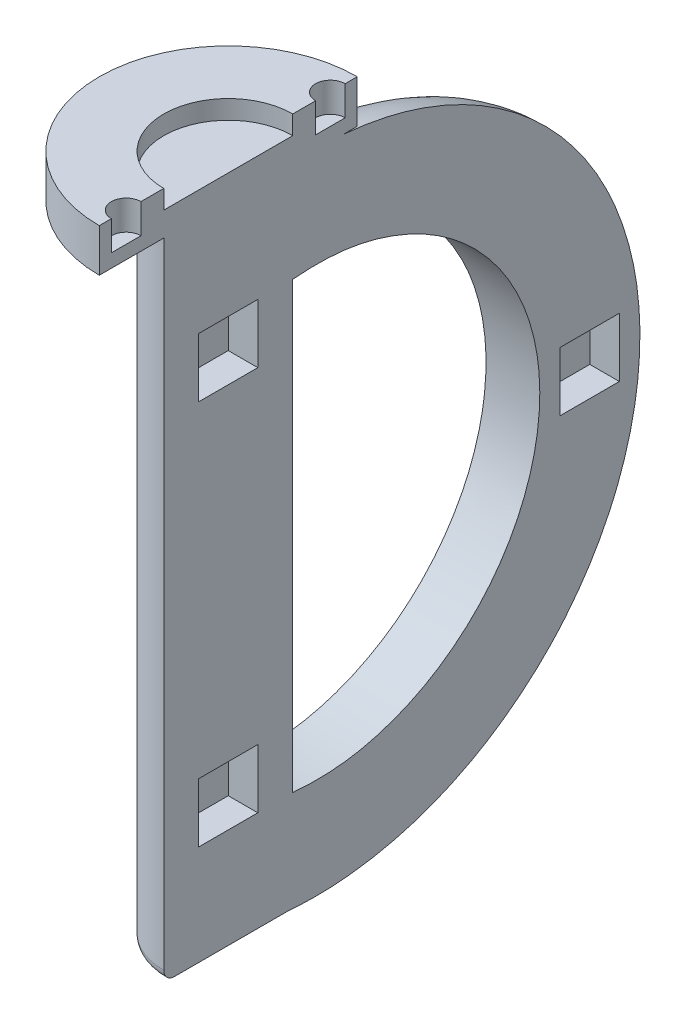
ISO-10303-21;
HEADER;
FILE_DESCRIPTION(('STEP AP214'),'2;1');
FILE_NAME('part.step','',(''),(''),'','','');
FILE_SCHEMA(('AUTOMOTIVE_DESIGN { 1 0 10303 214 1 1 1 1 }'));
ENDSEC;
DATA;
#1=APPLICATION_CONTEXT('core data for automotive mechanical design processes');
#2=APPLICATION_PROTOCOL_DEFINITION('international standard','automotive_design',2000,#1);
#3=PRODUCT_CONTEXT('',#1,'mechanical');
#4=PRODUCT('Part','Part','',(#3));
#5=PRODUCT_RELATED_PRODUCT_CATEGORY('part','',(#4));
#6=PRODUCT_DEFINITION_FORMATION('','',#4);
#7=PRODUCT_DEFINITION_CONTEXT('part definition',#1,'design');
#8=PRODUCT_DEFINITION('design','',#6,#7);
#9=PRODUCT_DEFINITION_SHAPE('','',#8);
#10=(LENGTH_UNIT() NAMED_UNIT(*) SI_UNIT(.MILLI.,.METRE.));
#11=(NAMED_UNIT(*) PLANE_ANGLE_UNIT() SI_UNIT($,.RADIAN.));
#12=(NAMED_UNIT(*) SI_UNIT($,.STERADIAN.) SOLID_ANGLE_UNIT());
#13=UNCERTAINTY_MEASURE_WITH_UNIT(LENGTH_MEASURE(1.E-05),#10,'distance_accuracy_value','');
#14=(GEOMETRIC_REPRESENTATION_CONTEXT(3) GLOBAL_UNCERTAINTY_ASSIGNED_CONTEXT((#13)) GLOBAL_UNIT_ASSIGNED_CONTEXT((#10,
#11,#12)) REPRESENTATION_CONTEXT('',''));
#15=CARTESIAN_POINT('',(0.,0.,0.));
#16=DIRECTION('',(0.,0.,1.));
#17=DIRECTION('',(1.,0.,0.));
#18=AXIS2_PLACEMENT_3D('',#15,#16,#17);
#19=CARTESIAN_POINT('',(0.,0.,0.));
#20=DIRECTION('',(0.,1.,0.));
#21=DIRECTION('',(0.,0.,1.));
#22=AXIS2_PLACEMENT_3D('',#19,#20,#21);
#23=PLANE('',#22);
#24=CARTESIAN_POINT('',(0.,0.,0.));
#25=DIRECTION('',(0.,1.,0.));
#26=DIRECTION('',(0.,0.,1.));
#27=AXIS2_PLACEMENT_3D('',#24,#25,#26);
#28=CIRCLE('',#27,24.);
#29=CARTESIAN_POINT('',(0.,0.,-24.));
#30=VERTEX_POINT('',#29);
#31=CARTESIAN_POINT('',(0.,0.,24.));
#32=VERTEX_POINT('',#31);
#33=EDGE_CURVE('E368',#30,#32,#28,.T.);
#34=ORIENTED_EDGE('',*,*,#33,.F.);
#35=DIRECTION('',(0.,0.,1.));
#36=VECTOR('',#35,1.);
#37=CARTESIAN_POINT('',(0.,0.,0.));
#38=LINE('',#37,#36);
#39=CARTESIAN_POINT('',(0.,0.,-21.3993650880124));
#40=VERTEX_POINT('',#39);
#41=EDGE_CURVE('E398',#30,#40,#38,.T.);
#42=ORIENTED_EDGE('',*,*,#41,.T.);
#43=CARTESIAN_POINT('',(0.,0.,-11.4508895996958));
#44=CARTESIAN_POINT('',(-0.0676941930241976,0.,-11.4508888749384));
#45=CARTESIAN_POINT('',(-0.135386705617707,0.,-11.4572236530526));
#46=CARTESIAN_POINT('',(-0.268564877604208,0.,-11.481855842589));
#47=CARTESIAN_POINT('',(-0.334048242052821,0.,-11.500165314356));
#48=CARTESIAN_POINT('',(-0.474643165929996,0.,-11.5520036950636));
#49=CARTESIAN_POINT('',(-0.548856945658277,0.,-11.5879345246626));
#50=CARTESIAN_POINT('',(-0.690599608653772,0.,-11.671337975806));
#51=CARTESIAN_POINT('',(-0.758106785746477,0.,-11.7188464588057));
#52=CARTESIAN_POINT('',(-0.872174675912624,0.,-11.8108932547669));
#53=CARTESIAN_POINT('',(-0.920083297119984,0.,-11.8538000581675));
#54=CARTESIAN_POINT('',(-1.01189568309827,0.,-11.9435520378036));
#55=CARTESIAN_POINT('',(-1.0558052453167,0.,-11.9903913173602));
#56=CARTESIAN_POINT('',(-1.14010896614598,0.,-12.0873271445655));
#57=CARTESIAN_POINT('',(-1.18049347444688,0.,-12.1374320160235));
#58=CARTESIAN_POINT('',(-1.25794595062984,0.,-12.2401581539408));
#59=CARTESIAN_POINT('',(-1.29501244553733,0.,-12.2927805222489));
#60=CARTESIAN_POINT('',(-1.39755974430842,-1.29790876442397E-13,-12.4474467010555));
#61=CARTESIAN_POINT('',(-1.45918865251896,0.,-12.552051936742));
#62=CARTESIAN_POINT('',(-1.57338713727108,0.,-12.7660883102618));
#63=CARTESIAN_POINT('',(-1.6259501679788,0.,-12.8755228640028));
#64=CARTESIAN_POINT('',(-1.72337270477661,0.,-13.097998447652));
#65=CARTESIAN_POINT('',(-1.7682168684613,0.,-13.2110461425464));
#66=CARTESIAN_POINT('',(-1.85105383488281,0.,-13.4395719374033));
#67=CARTESIAN_POINT('',(-1.8890480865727,0.,-13.5550495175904));
#68=CARTESIAN_POINT('',(-1.95861273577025,0.,-13.7866763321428));
#69=CARTESIAN_POINT('',(-1.99024252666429,0.,-13.9028078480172));
#70=CARTESIAN_POINT('',(-2.0481028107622,0.,-14.1364159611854));
#71=CARTESIAN_POINT('',(-2.0743323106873,0.,-14.2538928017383));
#72=CARTESIAN_POINT('',(-2.14562609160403,0.,-14.6079761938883));
#73=CARTESIAN_POINT('',(-2.18325696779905,0.,-14.8461023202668));
#74=CARTESIAN_POINT('',(-2.24110543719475,0.,-15.3248585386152));
#75=CARTESIAN_POINT('',(-2.26128788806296,0.,-15.5654927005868));
#76=CARTESIAN_POINT('',(-2.28535197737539,0.,-16.0474590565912));
#77=CARTESIAN_POINT('',(-2.2892408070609,0.,-16.2887908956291));
#78=CARTESIAN_POINT('',(-2.28080066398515,0.,-16.7923937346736));
#79=CARTESIAN_POINT('',(-2.26701590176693,0.,-17.0546404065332));
#80=CARTESIAN_POINT('',(-2.22015841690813,0.,-17.5776770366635));
#81=CARTESIAN_POINT('',(-2.18707082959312,0.,-17.8384657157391));
#82=CARTESIAN_POINT('',(-2.12158774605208,0.,-18.2271262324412));
#83=CARTESIAN_POINT('',(-2.09709316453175,0.,-18.356357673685));
#84=CARTESIAN_POINT('',(-2.04241266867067,0.,-18.6136036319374));
#85=CARTESIAN_POINT('',(-2.01222766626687,0.,-18.7416183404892));
#86=CARTESIAN_POINT('',(-1.94568866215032,0.,-18.9958654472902));
#87=CARTESIAN_POINT('',(-1.90934278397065,0.,-19.1220999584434));
#88=CARTESIAN_POINT('',(-1.8297535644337,0.,-19.3723514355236));
#89=CARTESIAN_POINT('',(-1.78651239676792,0.,-19.4963690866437));
#90=CARTESIAN_POINT('',(-1.69354693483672,0.,-19.737778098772));
#91=CARTESIAN_POINT('',(-1.64405229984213,0.,-19.8552569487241));
#92=CARTESIAN_POINT('',(-1.53637894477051,0.,-20.0863417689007));
#93=CARTESIAN_POINT('',(-1.47819182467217,0.,-20.1999438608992));
#94=CARTESIAN_POINT('',(-1.35204522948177,0.,-20.4203708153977));
#95=CARTESIAN_POINT('',(-1.28417997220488,0.,-20.5272481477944));
#96=CARTESIAN_POINT('',(-1.1732323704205,0.,-20.6808016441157));
#97=CARTESIAN_POINT('',(-1.13476129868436,0.,-20.7308195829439));
#98=CARTESIAN_POINT('',(-1.05442529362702,0.,-20.8280359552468));
#99=CARTESIAN_POINT('',(-1.01256241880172,0.,-20.8752360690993));
#100=CARTESIAN_POINT('',(-0.937895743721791,0.,-20.95276128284));
#101=CARTESIAN_POINT('',(-0.90602370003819,0.,-20.9839841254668));
#102=CARTESIAN_POINT('',(-0.84030397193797,0.,-21.0442652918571));
#103=CARTESIAN_POINT('',(-0.806457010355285,0.,-21.0733243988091));
#104=CARTESIAN_POINT('',(-0.736751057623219,0.,-21.1288025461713));
#105=CARTESIAN_POINT('',(-0.700895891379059,0.,-21.155226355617));
#106=CARTESIAN_POINT('',(-0.627044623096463,0.,-21.2049991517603));
#107=CARTESIAN_POINT('',(-0.589045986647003,0.,-21.2283443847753));
#108=CARTESIAN_POINT('',(-0.493066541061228,0.,-21.2811804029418));
#109=CARTESIAN_POINT('',(-0.433904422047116,0.,-21.3085890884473));
#110=CARTESIAN_POINT('',(-0.311964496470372,0.,-21.3534080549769));
#111=CARTESIAN_POINT('',(-0.249193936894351,0.,-21.3708376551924));
#112=CARTESIAN_POINT('',(-0.120964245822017,0.,-21.3941118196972));
#113=CARTESIAN_POINT('',(-0.0554877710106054,0.,-21.3998636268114));
#114=CARTESIAN_POINT('',(0.0753601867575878,0.,-21.3988008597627));
#115=CARTESIAN_POINT('',(0.140731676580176,0.,-21.3919871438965));
#116=CARTESIAN_POINT('',(0.262447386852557,0.,-21.3679556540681));
#117=CARTESIAN_POINT('',(0.31902697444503,0.,-21.3518842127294));
#118=CARTESIAN_POINT('',(0.42926648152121,0.,-21.3116180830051));
#119=CARTESIAN_POINT('',(0.482921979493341,0.,-21.2874114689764));
#120=CARTESIAN_POINT('',(0.575708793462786,0.,-21.2382129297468));
#121=CARTESIAN_POINT('',(0.615515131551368,0.,-21.2144654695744));
#122=CARTESIAN_POINT('',(0.692826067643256,0.,-21.1635686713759));
#123=CARTESIAN_POINT('',(0.730332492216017,0.,-21.1364220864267));
#124=CARTESIAN_POINT('',(0.839713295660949,0.,-21.0505937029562));
#125=CARTESIAN_POINT('',(0.908247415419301,0.,-20.987636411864));
#126=CARTESIAN_POINT('',(1.02915740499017,0.,-20.8623747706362));
#127=CARTESIAN_POINT('',(1.08248314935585,0.,-20.8009569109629));
#128=CARTESIAN_POINT('',(1.18370335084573,0.,-20.6737496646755));
#129=CARTESIAN_POINT('',(1.23159399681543,0.,-20.6079572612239));
#130=CARTESIAN_POINT('',(1.32261461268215,0.,-20.4730558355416));
#131=CARTESIAN_POINT('',(1.3657376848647,2.39002855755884E-13,-20.403942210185));
#132=CARTESIAN_POINT('',(1.44773115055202,-2.39091390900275E-13,-20.2632187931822));
#133=CARTESIAN_POINT('',(1.48659996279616,-8.9256801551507E-13,-20.1916080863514));
#134=CARTESIAN_POINT('',(1.56145627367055,-9.14487297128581E-13,-20.0446513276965));
#135=CARTESIAN_POINT('',(1.59734782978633,-2.50500438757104E-13,-19.9692566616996));
#136=CARTESIAN_POINT('',(1.66554939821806,2.50552331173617E-13,-19.8168578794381));
#137=CARTESIAN_POINT('',(1.69785866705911,0.,-19.7398534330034));
#138=CARTESIAN_POINT('',(1.78996822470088,-1.7500024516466E-13,-19.5068149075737));
#139=CARTESIAN_POINT('',(1.8449050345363,0.,-19.3488470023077));
#140=CARTESIAN_POINT('',(1.94392596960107,0.,-19.0290902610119));
#141=CARTESIAN_POINT('',(1.98797622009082,0.,-18.8672911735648));
#142=CARTESIAN_POINT('',(2.06633448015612,0.,-18.5414196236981));
#143=CARTESIAN_POINT('',(2.10064549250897,0.,-18.3773478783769));
#144=CARTESIAN_POINT('',(2.15682665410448,0.,-18.0675507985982));
#145=CARTESIAN_POINT('',(2.17969922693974,0.,-17.9220047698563));
#146=CARTESIAN_POINT('',(2.21902766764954,0.,-17.630040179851));
#147=CARTESIAN_POINT('',(2.2354827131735,0.,-17.4836215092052));
#148=CARTESIAN_POINT('',(2.27566763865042,0.,-17.0433095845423));
#149=CARTESIAN_POINT('',(2.29018611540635,0.,-16.7485373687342));
#150=CARTESIAN_POINT('',(2.29539987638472,0.,-16.1596804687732));
#151=CARTESIAN_POINT('',(2.28616803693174,0.,-15.865596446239));
#152=CARTESIAN_POINT('',(2.25379149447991,0.,-15.4260106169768));
#153=CARTESIAN_POINT('',(2.23991887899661,0.,-15.2797871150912));
#154=CARTESIAN_POINT('',(2.2056822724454,0.,-14.9881109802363));
#155=CARTESIAN_POINT('',(2.18531945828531,0.,-14.8426582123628));
#156=CARTESIAN_POINT('',(2.14379099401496,0.,-14.5901609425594));
#157=CARTESIAN_POINT('',(2.12417869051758,0.,-14.4828592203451));
#158=CARTESIAN_POINT('',(2.0808806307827,0.,-14.2690828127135));
#159=CARTESIAN_POINT('',(2.05719516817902,0.,-14.1626080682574));
#160=CARTESIAN_POINT('',(2.0054041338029,0.,-13.9505871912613));
#161=CARTESIAN_POINT('',(1.97729286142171,0.,-13.8450424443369));
#162=CARTESIAN_POINT('',(1.91627365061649,0.,-13.6353439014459));
#163=CARTESIAN_POINT('',(1.88336586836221,-2.67926941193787E-13,-13.5311900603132));
#164=CARTESIAN_POINT('',(1.81195278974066,-2.69814189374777E-13,-13.3238477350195));
#165=CARTESIAN_POINT('',(1.77340369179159,0.,-13.2206742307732));
#166=CARTESIAN_POINT('',(1.69023367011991,0.,-13.0167434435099));
#167=CARTESIAN_POINT('',(1.6456107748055,0.,-12.9159869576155));
#168=CARTESIAN_POINT('',(1.54960330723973,0.,-12.7181182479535));
#169=CARTESIAN_POINT('',(1.49824096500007,0.,-12.620995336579));
#170=CARTESIAN_POINT('',(1.3876043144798,0.,-12.431415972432));
#171=CARTESIAN_POINT('',(1.3283375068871,0.,-12.3389552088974));
#172=CARTESIAN_POINT('',(1.20923901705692,0.,-12.1728029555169));
#173=CARTESIAN_POINT('',(1.15058952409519,0.,-12.0982725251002));
#174=CARTESIAN_POINT('',(1.02526052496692,0.,-11.9560238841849));
#175=CARTESIAN_POINT('',(0.958572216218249,0.,-11.8883132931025));
#176=CARTESIAN_POINT('',(0.815363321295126,0.,-11.7620066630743));
#177=CARTESIAN_POINT('',(0.738728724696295,0.,-11.7035371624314));
#178=CARTESIAN_POINT('',(0.576073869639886,0.,-11.6015230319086));
#179=CARTESIAN_POINT('',(0.490084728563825,-1.37397542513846E-13,-11.5579308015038));
#180=CARTESIAN_POINT('',(0.336300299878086,-1.03074652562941E-13,-11.5008327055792));
#181=CARTESIAN_POINT('',(0.270392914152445,0.,-11.4822784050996));
#182=CARTESIAN_POINT('',(0.136321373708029,0.,-11.4573140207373));
#183=CARTESIAN_POINT('',(0.0681598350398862,0.,-11.4508903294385));
#184=CARTESIAN_POINT('',(0.,0.,-11.4508895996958));
#185=B_SPLINE_CURVE_WITH_KNOTS('',3,(#43,#44,#45,#46,#47,#48,#49,#50,#51,#52,#53,#54,#55,#56,
#57,#58,#59,#60,#61,#62,#63,#64,#65,#66,#67,#68,#69,#70,#71,#72,#73,#74,#75,#76,#77,#78,#79,#80,
#81,#82,#83,#84,#85,#86,#87,#88,#89,#90,#91,#92,#93,#94,#95,#96,#97,#98,#99,#100,#101,#102,#103,
#104,#105,#106,#107,#108,#109,#110,#111,#112,#113,#114,#115,#116,#117,#118,#119,#120,#121,#122,
#123,#124,#125,#126,#127,#128,#129,#130,#131,#132,#133,#134,#135,#136,#137,#138,#139,#140,#141,
#142,#143,#144,#145,#146,#147,#148,#149,#150,#151,#152,#153,#154,#155,#156,#157,#158,#159,#160,
#161,#162,#163,#164,#165,#166,#167,#168,#169,#170,#171,#172,#173,#174,#175,#176,#177,#178,#179,
#180,#181,#182,#183,#184),.UNSPECIFIED.,.T.,.F.,(4,2,2,2,2,2,2,2,2,2,2,2,2,2,2,2,2,2,2,2,2,2,2,
2,2,2,2,2,2,2,2,2,2,2,2,2,2,2,2,2,2,2,2,2,2,2,2,2,2,2,2,2,2,2,2,2,2,2,2,2,2,2,2,2,2,2,2,2,2,2,
4),(0.,0.202801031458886,0.405806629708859,0.651803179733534,0.898571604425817,1.09125042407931,
1.28364531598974,1.47655139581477,1.66954269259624,2.03316070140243,2.39704016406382,
2.76163474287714,3.1261521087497,3.4870915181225,3.84809725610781,4.57052371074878,
5.29440181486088,6.01796039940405,6.80512825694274,7.59290309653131,7.9873973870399,
8.38182851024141,8.77574353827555,9.16953463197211,9.551675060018,9.93418718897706,
10.3132018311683,10.5023892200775,10.6914626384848,10.8252332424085,10.958955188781,
11.0924305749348,11.2260672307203,11.4209074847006,11.6153692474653,11.8113696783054,
12.0073567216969,12.1831168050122,12.3591356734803,12.4979975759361,12.6367477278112,
12.9149337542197,13.1586354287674,13.4025069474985,13.6467268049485,13.8910371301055,
14.1414357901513,14.3918863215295,14.8930921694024,15.395838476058,15.8984296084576,
16.3402767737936,16.7821805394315,17.6665253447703,18.5481598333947,18.9886839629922,
19.4291282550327,19.7562973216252,20.0834428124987,20.4110131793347,20.7385728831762,
21.0688260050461,21.3991865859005,21.7284836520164,22.0574704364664,22.3415346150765,
22.6259127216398,22.9138988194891,23.2009546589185,23.4053801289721,23.6095761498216),.UNSPECIFIED.);
#186=CARTESIAN_POINT('',(-1.02287900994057,0.,-11.9563254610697));
#187=VERTEX_POINT('',#186);
#188=EDGE_CURVE('E371',#187,#40,#185,.T.);
#189=ORIENTED_EDGE('',*,*,#188,.F.);
#190=CARTESIAN_POINT('',(0.,0.,0.));
#191=DIRECTION('',(0.,1.,0.));
#192=DIRECTION('',(0.,0.,1.));
#193=AXIS2_PLACEMENT_3D('',#190,#191,#192);
#194=CIRCLE('',#193,12.);
#195=CARTESIAN_POINT('',(0.,0.,12.));
#196=VERTEX_POINT('',#195);
#197=EDGE_CURVE('E366',#196,#187,#194,.F.);
#198=ORIENTED_EDGE('',*,*,#197,.F.);
#199=EDGE_CURVE('E394',#196,#32,#38,.T.);
#200=ORIENTED_EDGE('',*,*,#199,.T.);
#201=EDGE_LOOP('',(#34,#42,#189,#198,#200));
#202=FACE_BOUND('',#201,.T.);
#203=ADVANCED_FACE('F39',(#202),#23,.F.);
#204=CARTESIAN_POINT('',(0.,-120.,0.));
#205=DIRECTION('',(0.,1.,0.));
#206=DIRECTION('',(-1.,0.,0.));
#207=AXIS2_PLACEMENT_3D('',#204,#205,#206);
#208=PLANE('',#207);
#209=DIRECTION('',(0.,0.,-1.));
#210=VECTOR('',#209,1.);
#211=CARTESIAN_POINT('',(0.,-120.,0.));
#212=LINE('',#211,#210);
#213=CARTESIAN_POINT('',(0.,-120.,10.));
#214=VERTEX_POINT('',#213);
#215=CARTESIAN_POINT('',(0.,-120.,-10.000002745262));
#216=VERTEX_POINT('',#215);
#217=EDGE_CURVE('E264',#214,#216,#212,.T.);
#218=ORIENTED_EDGE('',*,*,#217,.F.);
#219=CARTESIAN_POINT('',(0.,-120.,0.));
#220=DIRECTION('',(0.,1.,0.));
#221=DIRECTION('',(-1.,0.,0.));
#222=AXIS2_PLACEMENT_3D('',#219,#220,#221);
#223=CIRCLE('',#222,10.);
#224=EDGE_CURVE('E892',#214,#216,#223,.F.);
#225=ORIENTED_EDGE('',*,*,#224,.T.);
#226=EDGE_LOOP('',(#218,#225));
#227=FACE_BOUND('',#226,.T.);
#228=ADVANCED_FACE('F352',(#227),#208,.F.);
#229=CARTESIAN_POINT('',(0.,0.,0.));
#230=DIRECTION('',(0.,1.,0.));
#231=DIRECTION('',(-1.,0.,0.));
#232=AXIS2_PLACEMENT_3D('',#229,#230,#231);
#233=CYLINDRICAL_SURFACE('',#232,12.);
#234=CARTESIAN_POINT('',(-3.51088027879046,-119.474916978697,-11.4749169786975));
#235=CARTESIAN_POINT('',(-3.66628710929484,-119.427370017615,-11.4273700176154));
#236=CARTESIAN_POINT('',(-3.81987538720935,-119.376923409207,-11.376923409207));
#237=CARTESIAN_POINT('',(-4.12316492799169,-119.27055129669,-11.27055129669));
#238=CARTESIAN_POINT('',(-4.27286714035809,-119.214627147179,-11.2146271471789));
#239=CARTESIAN_POINT('',(-4.71525136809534,-119.039331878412,-11.0393318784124));
#240=CARTESIAN_POINT('',(-5.0018780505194,-118.912231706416,-10.912231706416));
#241=CARTESIAN_POINT('',(-5.55428771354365,-118.641593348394,-10.641593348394));
#242=CARTESIAN_POINT('',(-5.82026698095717,-118.498253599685,-10.4982535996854));
#243=CARTESIAN_POINT('',(-6.33443336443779,-118.196268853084,-10.1962688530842));
#244=CARTESIAN_POINT('',(-6.58260964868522,-118.037614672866,-10.0376146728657));
#245=CARTESIAN_POINT('',(-7.12000327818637,-117.666282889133,-9.66628288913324));
#246=CARTESIAN_POINT('',(-7.40417445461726,-117.449953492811,-9.44995349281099));
#247=CARTESIAN_POINT('',(-7.94445366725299,-117.000510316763,-9.00051031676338));
#248=CARTESIAN_POINT('',(-8.2005586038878,-116.767394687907,-8.76739468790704));
#249=CARTESIAN_POINT('',(-8.68666784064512,-116.286097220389,-8.28609722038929));
#250=CARTESIAN_POINT('',(-8.91652528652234,-116.037841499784,-8.03784149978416));
#251=CARTESIAN_POINT('',(-9.34940271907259,-115.529941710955,-7.52994171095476));
#252=CARTESIAN_POINT('',(-9.55242074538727,-115.270296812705,-7.27029681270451));
#253=CARTESIAN_POINT('',(-10.0094988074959,-114.63469120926,-6.63469120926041));
#254=CARTESIAN_POINT('',(-10.2509639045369,-114.254183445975,-6.25418344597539));
#255=CARTESIAN_POINT('',(-10.6851715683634,-113.479453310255,-5.47945331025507));
#256=CARTESIAN_POINT('',(-10.8778911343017,-113.085224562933,-5.08522456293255));
#257=CARTESIAN_POINT('',(-11.2163002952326,-112.287432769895,-4.28743276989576));
#258=CARTESIAN_POINT('',(-11.3620530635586,-111.883883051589,-3.8838830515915));
#259=CARTESIAN_POINT('',(-11.6083890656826,-111.070165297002,-3.07016529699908));
#260=CARTESIAN_POINT('',(-11.7089923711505,-110.6600002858,-2.66000028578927));
#261=CARTESIAN_POINT('',(-11.8581631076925,-109.877733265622,-1.87773326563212));
#262=CARTESIAN_POINT('',(-11.9110018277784,-109.506031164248,-1.50603116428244));
#263=CARTESIAN_POINT('',(-11.9816538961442,-108.761346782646,-0.761346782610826));
#264=CARTESIAN_POINT('',(-11.9995087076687,-108.388366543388,-0.388366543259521));
#265=CARTESIAN_POINT('',(-11.9999966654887,-108.010327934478,-0.0103279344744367));
#266=CARTESIAN_POINT('',(-11.9999999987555,-108.005163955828,-0.00516395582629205));
#267=CARTESIAN_POINT('',(-12.0000000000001,-108.,0.));
#268=B_SPLINE_CURVE_WITH_KNOTS('',3,(#234,#235,#236,#237,#238,#239,#240,#241,#242,#243,#244,
#245,#246,#247,#248,#249,#250,#251,#252,#253,#254,#255,#256,#257,#258,#259,#260,#261,#262,#263,
#264,#265,#266,#267),.UNSPECIFIED.,.F.,.F.,(4,2,2,2,2,2,2,2,2,2,2,2,2,2,2,2,4),(0.,
0.507859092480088,1.01559290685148,2.02888638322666,3.03091571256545,4.03354962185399,
5.28435359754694,6.5352955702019,7.79292511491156,9.05064646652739,10.8173779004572,
12.5849414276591,14.3501174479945,16.1145079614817,17.6983529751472,19.2803196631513,
19.3022285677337),.UNSPECIFIED.);
#269=CARTESIAN_POINT('',(-6.63324958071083,-118.,-9.99999999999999));
#270=VERTEX_POINT('',#269);
#271=CARTESIAN_POINT('',(-12.0000000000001,-108.,0.));
#272=VERTEX_POINT('',#271);
#273=EDGE_CURVE('E340',#270,#272,#268,.T.);
#274=ORIENTED_EDGE('',*,*,#273,.F.);
#275=CARTESIAN_POINT('',(0.,-118.,0.));
#276=DIRECTION('',(0.,1.,0.));
#277=DIRECTION('',(-1.,0.,0.));
#278=AXIS2_PLACEMENT_3D('',#275,#276,#277);
#279=CIRCLE('',#278,12.);
#280=CARTESIAN_POINT('',(0.,-118.,12.));
#281=VERTEX_POINT('',#280);
#282=EDGE_CURVE('E276',#270,#281,#279,.T.);
#283=ORIENTED_EDGE('',*,*,#282,.T.);
#284=DIRECTION('',(0.,1.,0.));
#285=VECTOR('',#284,1.);
#286=CARTESIAN_POINT('',(0.,0.,12.));
#287=LINE('',#286,#285);
#288=EDGE_CURVE('E396',#281,#196,#287,.T.);
#289=ORIENTED_EDGE('',*,*,#288,.T.);
#290=ORIENTED_EDGE('',*,*,#197,.T.);
#291=CARTESIAN_POINT('',(-3.51088027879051,-0.525083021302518,-11.4749169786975));
#292=CARTESIAN_POINT('',(-3.4316144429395,-0.498504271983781,-11.4991697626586));
#293=CARTESIAN_POINT('',(-3.35184003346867,-0.472759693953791,-11.5226789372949));
#294=CARTESIAN_POINT('',(-3.19160595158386,-0.423070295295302,-11.5680836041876));
#295=CARTESIAN_POINT('',(-3.11114964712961,-0.399119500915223,-11.5899844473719));
#296=CARTESIAN_POINT('',(-2.94954611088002,-0.353024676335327,-11.6321594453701));
#297=CARTESIAN_POINT('',(-2.86840131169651,-0.33087597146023,-11.652437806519));
#298=CARTESIAN_POINT('',(-2.7054149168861,-0.288394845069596,-11.6913530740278));
#299=CARTESIAN_POINT('',(-2.62357487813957,-0.268059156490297,-11.7099929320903));
#300=CARTESIAN_POINT('',(-2.45919028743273,-0.229216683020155,-11.7456140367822));
#301=CARTESIAN_POINT('',(-2.37664649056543,-0.210708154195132,-11.7625968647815));
#302=CARTESIAN_POINT('',(-2.21082624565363,-0.175531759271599,-11.7948880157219));
#303=CARTESIAN_POINT('',(-2.12754967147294,-0.158864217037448,-11.8101960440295));
#304=CARTESIAN_POINT('',(-1.96027497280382,-0.127394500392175,-11.8391102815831));
#305=CARTESIAN_POINT('',(-1.87627629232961,-0.112593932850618,-11.8527150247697));
#306=CARTESIAN_POINT('',(-1.70755025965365,-0.0848815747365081,-11.8781970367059));
#307=CARTESIAN_POINT('',(-1.6228218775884,-0.071973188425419,-11.8900711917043));
#308=CARTESIAN_POINT('',(-1.45262805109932,-0.0480723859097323,-11.912063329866));
#309=CARTESIAN_POINT('',(-1.36716122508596,-0.0370853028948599,-11.9221764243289));
#310=CARTESIAN_POINT('',(-1.19548172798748,-0.0170569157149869,-11.9406159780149));
#311=CARTESIAN_POINT('',(-1.10926746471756,-0.00802300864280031,-11.9489356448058));
#312=CARTESIAN_POINT('',(-1.02287900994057,0.,-11.9563254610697));
#313=B_SPLINE_CURVE_WITH_KNOTS('',3,(#291,#292,#293,#294,#295,#296,#297,#298,#299,#300,#301,
#302,#303,#304,#305,#306,#307,#308,#309,#310,#311,#312),.UNSPECIFIED.,.F.,.F.,(4,2,2,2,2,2,2,2,
2,2,4),(0.,0.261143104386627,0.521373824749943,0.780906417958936,1.03996145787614,
1.29876680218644,1.55761760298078,1.81668969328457,2.07622231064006,2.33646428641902,
2.5976752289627),.UNSPECIFIED.);
#314=CARTESIAN_POINT('',(-3.51088027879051,-0.525083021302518,-11.4749169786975));
#315=VERTEX_POINT('',#314);
#316=EDGE_CURVE('E331',#315,#187,#313,.T.);
#317=ORIENTED_EDGE('',*,*,#316,.F.);
#318=CARTESIAN_POINT('',(0.,-12.,0.));
#319=DIRECTION('',(0.,0.707106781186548,0.707106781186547));
#320=DIRECTION('',(0.,0.707106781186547,-0.707106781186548));
#321=AXIS2_PLACEMENT_3D('',#318,#319,#320);
#322=ELLIPSE('',#321,16.9705627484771,12.);
#323=CARTESIAN_POINT('',(-12.,-12.,0.));
#324=VERTEX_POINT('',#323);
#325=EDGE_CURVE('E339',#315,#324,#322,.T.);
#326=ORIENTED_EDGE('',*,*,#325,.T.);
#327=CARTESIAN_POINT('',(0.,-12.,0.));
#328=DIRECTION('',(0.,0.707106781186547,-0.707106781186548));
#329=DIRECTION('',(0.,0.707106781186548,0.707106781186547));
#330=AXIS2_PLACEMENT_3D('',#327,#328,#329);
#331=ELLIPSE('',#330,16.9705627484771,12.);
#332=CARTESIAN_POINT('',(-10.,-18.6332495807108,-6.6332495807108));
#333=VERTEX_POINT('',#332);
#334=EDGE_CURVE('E675',#324,#333,#331,.F.);
#335=ORIENTED_EDGE('',*,*,#334,.T.);
#336=CARTESIAN_POINT('',(0.,-18.6332495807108,0.));
#337=DIRECTION('',(0.,-1.,0.));
#338=DIRECTION('',(0.,0.,-1.));
#339=AXIS2_PLACEMENT_3D('',#336,#337,#338);
#340=CIRCLE('',#339,12.);
#341=CARTESIAN_POINT('',(0.,-18.6332495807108,-12.));
#342=VERTEX_POINT('',#341);
#343=EDGE_CURVE('E673',#333,#342,#340,.T.);
#344=ORIENTED_EDGE('',*,*,#343,.T.);
#345=DIRECTION('',(0.,1.,0.));
#346=VECTOR('',#345,1.);
#347=CARTESIAN_POINT('',(0.,0.,-12.));
#348=LINE('',#347,#346);
#349=CARTESIAN_POINT('',(0.,-101.366750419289,-12.));
#350=VERTEX_POINT('',#349);
#351=EDGE_CURVE('E663',#342,#350,#348,.F.);
#352=ORIENTED_EDGE('',*,*,#351,.T.);
#353=CARTESIAN_POINT('',(0.,-101.366750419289,0.));
#354=DIRECTION('',(0.,-1.,0.));
#355=DIRECTION('',(0.,0.,-1.));
#356=AXIS2_PLACEMENT_3D('',#353,#354,#355);
#357=CIRCLE('',#356,12.);
#358=CARTESIAN_POINT('',(-9.99999999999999,-101.366750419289,-6.6332495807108));
#359=VERTEX_POINT('',#358);
#360=EDGE_CURVE('E363',#359,#350,#357,.T.);
#361=ORIENTED_EDGE('',*,*,#360,.F.);
#362=CARTESIAN_POINT('',(-9.99999999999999,-101.366750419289,-6.6332495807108));
#363=CARTESIAN_POINT('',(-10.1079076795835,-101.529437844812,-6.4705621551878));
#364=CARTESIAN_POINT('',(-10.2111253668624,-101.693651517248,-6.30634848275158));
#365=CARTESIAN_POINT('',(-10.4083660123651,-102.024794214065,-5.97520578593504));
#366=CARTESIAN_POINT('',(-10.502390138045,-102.191722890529,-5.80827710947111));
#367=CARTESIAN_POINT('',(-10.7708864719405,-102.695945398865,-5.30405460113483));
#368=CARTESIAN_POINT('',(-10.9319061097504,-103.036863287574,-4.96313671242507));
#369=CARTESIAN_POINT('',(-11.2188736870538,-103.725011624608,-4.2749883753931));
#370=CARTESIAN_POINT('',(-11.3449072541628,-104.072224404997,-3.9277755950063));
#371=CARTESIAN_POINT('',(-11.5634475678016,-104.771849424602,-3.22815057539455));
#372=CARTESIAN_POINT('',(-11.6559561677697,-105.124261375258,-2.87573862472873));
#373=CARTESIAN_POINT('',(-11.8211989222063,-105.893065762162,-2.10693423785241));
#374=CARTESIAN_POINT('',(-11.8878618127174,-106.31011069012,-1.68988930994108));
#375=CARTESIAN_POINT('',(-11.9769715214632,-107.146322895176,-0.85367710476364));
#376=CARTESIAN_POINT('',(-11.9994491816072,-107.56548848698,-0.43451151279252));
#377=CARTESIAN_POINT('',(-11.9999966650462,-107.989672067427,-0.0103279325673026));
#378=CARTESIAN_POINT('',(-11.9999999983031,-107.994836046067,-0.00516395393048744));
#379=CARTESIAN_POINT('',(-12.0000000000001,-108.,0.));
#380=B_SPLINE_CURVE_WITH_KNOTS('',3,(#362,#363,#364,#365,#366,#367,#368,#369,#370,#371,#372,
#373,#374,#375,#376,#377,#378,#379),.UNSPECIFIED.,.F.,.F.,(4,2,2,2,2,2,2,2,4),(0.,
0.76225011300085,1.52440330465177,3.04783422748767,4.56750303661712,6.08708781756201,
7.86607179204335,9.643813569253,9.66572247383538),.UNSPECIFIED.);
#381=EDGE_CURVE('E357',#272,#359,#380,.F.);
#382=ORIENTED_EDGE('',*,*,#381,.F.);
#383=EDGE_LOOP('',(#274,#283,#289,#290,#317,#326,#335,#344,#352,#361,#382));
#384=FACE_BOUND('',#383,.T.);
#385=ADVANCED_FACE('F346',(#384),#233,.T.);
#386=CARTESIAN_POINT('',(0.,8.,0.));
#387=DIRECTION('',(0.,-1.,0.));
#388=DIRECTION('',(0.,0.,-1.));
#389=AXIS2_PLACEMENT_3D('',#386,#387,#388);
#390=CYLINDRICAL_SURFACE('',#389,24.);
#391=CARTESIAN_POINT('',(0.,8.,0.));
#392=DIRECTION('',(0.,1.,0.));
#393=DIRECTION('',(0.,0.,1.));
#394=AXIS2_PLACEMENT_3D('',#391,#392,#393);
#395=CIRCLE('',#394,24.);
#396=CARTESIAN_POINT('',(0.,8.00000000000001,-24.));
#397=VERTEX_POINT('',#396);
#398=CARTESIAN_POINT('',(0.,8.00000000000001,24.));
#399=VERTEX_POINT('',#398);
#400=EDGE_CURVE('E249',#397,#399,#395,.T.);
#401=ORIENTED_EDGE('',*,*,#400,.F.);
#402=DIRECTION('',(0.,-1.,0.));
#403=VECTOR('',#402,1.);
#404=CARTESIAN_POINT('',(0.,8.,-24.));
#405=LINE('',#404,#403);
#406=EDGE_CURVE('E389',#397,#30,#405,.T.);
#407=ORIENTED_EDGE('',*,*,#406,.T.);
#408=ORIENTED_EDGE('',*,*,#33,.T.);
#409=DIRECTION('',(0.,-1.,0.));
#410=VECTOR('',#409,1.);
#411=CARTESIAN_POINT('',(0.,8.,24.));
#412=LINE('',#411,#410);
#413=EDGE_CURVE('E391',#32,#399,#412,.F.);
#414=ORIENTED_EDGE('',*,*,#413,.T.);
#415=EDGE_LOOP('',(#401,#407,#408,#414));
#416=FACE_BOUND('',#415,.T.);
#417=ADVANCED_FACE('F351',(#416),#390,.T.);
#418=CARTESIAN_POINT('',(0.,8.,0.));
#419=DIRECTION('',(0.,1.,0.));
#420=DIRECTION('',(0.,0.,1.));
#421=AXIS2_PLACEMENT_3D('',#418,#419,#420);
#422=PLANE('',#421);
#423=CARTESIAN_POINT('',(0.,8.,19.));
#424=DIRECTION('',(0.,1.,0.));
#425=DIRECTION('',(0.,0.,1.));
#426=AXIS2_PLACEMENT_3D('',#423,#424,#425);
#427=CIRCLE('',#426,2.75);
#428=CARTESIAN_POINT('',(0.,8.,16.25));
#429=VERTEX_POINT('',#428);
#430=CARTESIAN_POINT('',(0.,8.,21.75));
#431=VERTEX_POINT('',#430);
#432=EDGE_CURVE('E233',#429,#431,#427,.T.);
#433=ORIENTED_EDGE('',*,*,#432,.F.);
#434=DIRECTION('',(0.,0.,-1.));
#435=VECTOR('',#434,1.);
#436=CARTESIAN_POINT('',(0.,8.00000000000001,36.1347435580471));
#437=LINE('',#436,#435);
#438=CARTESIAN_POINT('',(0.,8.,12.));
#439=VERTEX_POINT('',#438);
#440=EDGE_CURVE('E251',#429,#439,#437,.T.);
#441=ORIENTED_EDGE('',*,*,#440,.T.);
#442=CARTESIAN_POINT('',(0.,8.,0.));
#443=DIRECTION('',(0.,1.,0.));
#444=DIRECTION('',(0.,0.,1.));
#445=AXIS2_PLACEMENT_3D('',#442,#443,#444);
#446=CIRCLE('',#445,12.);
#447=CARTESIAN_POINT('',(0.,8.,-12.));
#448=VERTEX_POINT('',#447);
#449=EDGE_CURVE('E460',#448,#439,#446,.T.);
#450=ORIENTED_EDGE('',*,*,#449,.F.);
#451=CARTESIAN_POINT('',(0.,8.,-16.25));
#452=VERTEX_POINT('',#451);
#453=EDGE_CURVE('E253',#448,#452,#437,.T.);
#454=ORIENTED_EDGE('',*,*,#453,.T.);
#455=CARTESIAN_POINT('',(0.,8.,-19.));
#456=DIRECTION('',(0.,1.,0.));
#457=DIRECTION('',(0.,0.,1.));
#458=AXIS2_PLACEMENT_3D('',#455,#456,#457);
#459=CIRCLE('',#458,2.75);
#460=CARTESIAN_POINT('',(0.,8.,-21.75));
#461=VERTEX_POINT('',#460);
#462=EDGE_CURVE('E468',#461,#452,#459,.T.);
#463=ORIENTED_EDGE('',*,*,#462,.F.);
#464=EDGE_CURVE('E257',#461,#397,#437,.T.);
#465=ORIENTED_EDGE('',*,*,#464,.T.);
#466=ORIENTED_EDGE('',*,*,#400,.T.);
#467=EDGE_CURVE('E243',#399,#431,#437,.T.);
#468=ORIENTED_EDGE('',*,*,#467,.T.);
#469=EDGE_LOOP('',(#433,#441,#450,#454,#463,#465,#466,#468));
#470=FACE_BOUND('',#469,.T.);
#471=ADVANCED_FACE('F247',(#470),#422,.T.);
#472=CARTESIAN_POINT('',(0.,-12.,-42.2613842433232));
#473=DIRECTION('',(0.,0.,1.));
#474=DIRECTION('',(0.,-1.,0.));
#475=AXIS2_PLACEMENT_3D('',#472,#473,#474);
#476=CYLINDRICAL_SURFACE('',#475,12.);
#477=ORIENTED_EDGE('',*,*,#325,.F.);
#478=CARTESIAN_POINT('',(0.,-12.,-12.));
#479=DIRECTION('',(0.,0.0457113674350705,-0.998954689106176));
#480=DIRECTION('',(0.,0.998954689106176,0.0457113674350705));
#481=AXIS2_PLACEMENT_3D('',#478,#479,#480);
#482=ELLIPSE('',#481,12.0125568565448,12.);
#483=CARTESIAN_POINT('',(-10.,-18.6332495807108,-12.3035321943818));
#484=VERTEX_POINT('',#483);
#485=EDGE_CURVE('E378',#315,#484,#482,.F.);
#486=ORIENTED_EDGE('',*,*,#485,.T.);
#487=DIRECTION('',(0.,0.,1.));
#488=VECTOR('',#487,1.);
#489=CARTESIAN_POINT('',(-10.,-18.6332495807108,-42.2613842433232));
#490=LINE('',#489,#488);
#491=EDGE_CURVE('E418',#484,#333,#490,.T.);
#492=ORIENTED_EDGE('',*,*,#491,.T.);
#493=ORIENTED_EDGE('',*,*,#334,.F.);
#494=EDGE_LOOP('',(#477,#486,#492,#493));
#495=FACE_BOUND('',#494,.T.);
#496=ADVANCED_FACE('F320',(#495),#476,.T.);
#497=CARTESIAN_POINT('',(10.,-18.6332495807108,-12.3035321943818));
#498=CARTESIAN_POINT('',(10.,-18.3895965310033,-14.9602969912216));
#499=CARTESIAN_POINT('',(10.,-18.3473104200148,-20.5135733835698));
#500=CARTESIAN_POINT('',(10.,-20.034284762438,-28.9010169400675));
#501=CARTESIAN_POINT('',(10.,-23.5774807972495,-37.1149143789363));
#502=CARTESIAN_POINT('',(10.,-28.9409258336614,-44.5362244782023));
#503=CARTESIAN_POINT('',(10.,-35.7973811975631,-50.6040321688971));
#504=CARTESIAN_POINT('',(10.,-43.6212483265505,-54.9430549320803));
#505=CARTESIAN_POINT('',(10.,-51.8040934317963,-57.4360512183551));
#506=CARTESIAN_POINT('',(10.,-59.9999999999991,-58.2287052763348));
#507=CARTESIAN_POINT('',(10.,-68.1959065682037,-57.4360512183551));
#508=CARTESIAN_POINT('',(10.,-76.378751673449,-54.9430549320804));
#509=CARTESIAN_POINT('',(10.,-84.2026188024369,-50.6040321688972));
#510=CARTESIAN_POINT('',(10.,-91.0590741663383,-44.5362244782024));
#511=CARTESIAN_POINT('',(10.,-96.4225192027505,-37.1149143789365));
#512=CARTESIAN_POINT('',(10.,-99.9657152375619,-28.9010169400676));
#513=CARTESIAN_POINT('',(10.,-101.652689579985,-20.5135733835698));
#514=CARTESIAN_POINT('',(10.,-101.610403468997,-14.9602969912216));
#515=CARTESIAN_POINT('',(10.,-101.366750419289,-12.3035321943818));
#516=CARTESIAN_POINT('',(16.0076713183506,-9.57634429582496,-11.8890954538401));
#517=CARTESIAN_POINT('',(16.0076713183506,-9.27712719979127,-15.1517242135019));
#518=CARTESIAN_POINT('',(16.0076713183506,-9.33734357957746,-21.8056207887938));
#519=CARTESIAN_POINT('',(16.0076713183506,-11.4353174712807,-31.9739840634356));
#520=CARTESIAN_POINT('',(16.0076713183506,-15.797326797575,-41.8855980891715));
#521=CARTESIAN_POINT('',(16.0076713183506,-22.3398008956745,-50.8424666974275));
#522=CARTESIAN_POINT('',(16.0076713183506,-30.675763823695,-58.1571447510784));
#523=CARTESIAN_POINT('',(16.0076713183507,-40.1668303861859,-63.3841807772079));
#524=CARTESIAN_POINT('',(16.0076713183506,-50.0805711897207,-66.3848083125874));
#525=CARTESIAN_POINT('',(16.0076713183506,-60.0000000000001,-67.3379233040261));
#526=CARTESIAN_POINT('',(16.0076713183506,-69.9194288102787,-66.3848083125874));
#527=CARTESIAN_POINT('',(16.0076713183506,-79.8331696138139,-63.384180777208));
#528=CARTESIAN_POINT('',(16.0076713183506,-89.3242361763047,-58.1571447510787));
#529=CARTESIAN_POINT('',(16.0076713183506,-97.6601991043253,-50.8424666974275));
#530=CARTESIAN_POINT('',(16.0076713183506,-104.202673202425,-41.8855980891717));
#531=CARTESIAN_POINT('',(16.0076713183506,-108.564682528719,-31.9739840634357));
#532=CARTESIAN_POINT('',(16.0076713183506,-110.662656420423,-21.8056207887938));
#533=CARTESIAN_POINT('',(16.0076713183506,-110.722872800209,-15.1517242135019));
#534=CARTESIAN_POINT('',(16.0076713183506,-110.423655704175,-11.8890954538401));
#535=CARTESIAN_POINT('',(10.868286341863,0.,-11.4508895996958));
#536=CARTESIAN_POINT('',(10.868286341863,0.35478114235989,-15.3193823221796));
#537=CARTESIAN_POINT('',(10.868286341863,0.190950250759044,-23.1889992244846));
#538=CARTESIAN_POINT('',(10.868286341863,-2.34363256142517,-35.2182075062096));
#539=CARTESIAN_POINT('',(10.868286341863,-7.57083079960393,-46.9312925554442));
#540=CARTESIAN_POINT('',(10.868286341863,-15.3601176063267,-57.5100107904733));
#541=CARTESIAN_POINT('',(10.868286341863,-25.2603981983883,-66.1435486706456));
#542=CARTESIAN_POINT('',(10.868286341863,-36.5142941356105,-72.3094038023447));
#543=CARTESIAN_POINT('',(10.868286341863,-48.2581995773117,-75.8468083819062));
#544=CARTESIAN_POINT('',(10.868286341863,-60.0000000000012,-76.9695774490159));
#545=CARTESIAN_POINT('',(10.868286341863,-71.7418004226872,-75.8468083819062));
#546=CARTESIAN_POINT('',(10.868286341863,-83.4857058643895,-72.3094038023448));
#547=CARTESIAN_POINT('',(10.868286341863,-94.7396018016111,-66.143548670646));
#548=CARTESIAN_POINT('',(10.868286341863,-104.639882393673,-57.5100107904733));
#549=CARTESIAN_POINT('',(10.868286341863,-112.429169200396,-46.9312925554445));
#550=CARTESIAN_POINT('',(10.868286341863,-117.656367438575,-35.2182075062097));
#551=CARTESIAN_POINT('',(10.868286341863,-120.190950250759,-23.1889992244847));
#552=CARTESIAN_POINT('',(10.868286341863,-120.35478114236,-15.3193823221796));
#553=CARTESIAN_POINT('',(10.868286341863,-120.,-11.4508895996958));
#554=CARTESIAN_POINT('',(-10.868286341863,0.,-11.4508895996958));
#555=CARTESIAN_POINT('',(-10.868286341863,0.343474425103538,-15.196095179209));
#556=CARTESIAN_POINT('',(-10.868286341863,0.19655625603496,-23.2501264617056));
#557=CARTESIAN_POINT('',(-10.868286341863,-2.3452552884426,-35.2005134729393));
#558=CARTESIAN_POINT('',(-10.868286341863,-7.57037570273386,-46.9362548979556));
#559=CARTESIAN_POINT('',(-10.868286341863,-15.3602408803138,-57.5086665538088));
#560=CARTESIAN_POINT('',(-10.868286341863,-25.2603659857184,-66.1439001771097));
#561=CARTESIAN_POINT('',(-10.868286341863,-36.5143022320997,-72.3093145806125));
#562=CARTESIAN_POINT('',(-10.868286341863,-48.2581977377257,-75.8468316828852));
#563=CARTESIAN_POINT('',(-10.868286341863,-60.0000000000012,-76.9695661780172));
#564=CARTESIAN_POINT('',(-10.868286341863,-71.7418022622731,-75.8468316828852));
#565=CARTESIAN_POINT('',(-10.868286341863,-83.4856977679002,-72.3093145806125));
#566=CARTESIAN_POINT('',(-10.868286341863,-94.7396340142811,-66.1439001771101));
#567=CARTESIAN_POINT('',(-10.868286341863,-104.639759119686,-57.5086665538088));
#568=CARTESIAN_POINT('',(-10.868286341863,-112.429624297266,-46.9362548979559));
#569=CARTESIAN_POINT('',(-10.868286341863,-117.654744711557,-35.2005134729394));
#570=CARTESIAN_POINT('',(-10.868286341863,-120.196556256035,-23.2501264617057));
#571=CARTESIAN_POINT('',(-10.868286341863,-120.343474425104,-15.1960951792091));
#572=CARTESIAN_POINT('',(-10.868286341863,-120.,-11.4508895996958));
#573=CARTESIAN_POINT('',(-16.0076713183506,-9.57634429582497,-11.8890954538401));
#574=CARTESIAN_POINT('',(-16.0076713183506,-9.29974063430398,-14.9051499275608));
#575=CARTESIAN_POINT('',(-16.0076713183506,-9.32613156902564,-21.9278752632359));
#576=CARTESIAN_POINT('',(-16.0076713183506,-11.4385629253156,-31.938595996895));
#577=CARTESIAN_POINT('',(-16.0076713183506,-15.7964166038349,-41.8955227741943));
#578=CARTESIAN_POINT('',(-16.0076713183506,-22.3400474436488,-50.8397782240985));
#579=CARTESIAN_POINT('',(-16.0076713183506,-30.6756993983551,-58.1578477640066));
#580=CARTESIAN_POINT('',(-16.0076713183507,-40.1668465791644,-63.3840023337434));
#581=CARTESIAN_POINT('',(-16.0076713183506,-50.0805675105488,-66.3848549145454));
#582=CARTESIAN_POINT('',(-16.0076713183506,-60.0000000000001,-67.3379007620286));
#583=CARTESIAN_POINT('',(-16.0076713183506,-69.9194324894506,-66.3848549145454));
#584=CARTESIAN_POINT('',(-16.0076713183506,-79.8331534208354,-63.3840023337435));
#585=CARTESIAN_POINT('',(-16.0076713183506,-89.3243006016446,-58.1578477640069));
#586=CARTESIAN_POINT('',(-16.0076713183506,-97.659952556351,-50.8397782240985));
#587=CARTESIAN_POINT('',(-16.0076713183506,-104.203583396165,-41.8955227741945));
#588=CARTESIAN_POINT('',(-16.0076713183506,-108.561437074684,-31.9385959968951));
#589=CARTESIAN_POINT('',(-16.0076713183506,-110.673868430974,-21.927875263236));
#590=CARTESIAN_POINT('',(-16.0076713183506,-110.700259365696,-14.9051499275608));
#591=CARTESIAN_POINT('',(-16.0076713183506,-110.423655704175,-11.8890954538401));
#592=CARTESIAN_POINT('',(-10.,-18.6332495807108,-12.3035321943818));
#593=CARTESIAN_POINT('',(-10.,-18.3895965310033,-14.9602969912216));
#594=CARTESIAN_POINT('',(-10.,-18.3473104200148,-20.5135733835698));
#595=CARTESIAN_POINT('',(-10.,-20.034284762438,-28.9010169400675));
#596=CARTESIAN_POINT('',(-10.,-23.5774807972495,-37.1149143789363));
#597=CARTESIAN_POINT('',(-10.,-28.9409258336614,-44.5362244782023));
#598=CARTESIAN_POINT('',(-10.,-35.7973811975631,-50.6040321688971));
#599=CARTESIAN_POINT('',(-10.,-43.6212483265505,-54.9430549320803));
#600=CARTESIAN_POINT('',(-10.,-51.8040934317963,-57.4360512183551));
#601=CARTESIAN_POINT('',(-10.,-59.9999999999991,-58.2287052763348));
#602=CARTESIAN_POINT('',(-10.,-68.1959065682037,-57.4360512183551));
#603=CARTESIAN_POINT('',(-10.,-76.378751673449,-54.9430549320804));
#604=CARTESIAN_POINT('',(-10.,-84.2026188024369,-50.6040321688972));
#605=CARTESIAN_POINT('',(-10.,-91.0590741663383,-44.5362244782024));
#606=CARTESIAN_POINT('',(-10.,-96.4225192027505,-37.1149143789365));
#607=CARTESIAN_POINT('',(-10.,-99.9657152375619,-28.9010169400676));
#608=CARTESIAN_POINT('',(-10.,-101.652689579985,-20.5135733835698));
#609=CARTESIAN_POINT('',(-10.,-101.610403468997,-14.9602969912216));
#610=CARTESIAN_POINT('',(-10.,-101.366750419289,-12.3035321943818));
#611=(BOUNDED_SURFACE() B_SPLINE_SURFACE(3,3,((#497,#498,#499,#500,#501,#502,#503,#504,#505,
#506,#507,#508,#509,#510,#511,#512,#513,#514,#515),(#516,#517,#518,#519,#520,#521,#522,#523,
#524,#525,#526,#527,#528,#529,#530,#531,#532,#533,#534),(#535,#536,#537,#538,#539,#540,#541,
#542,#543,#544,#545,#546,#547,#548,#549,#550,#551,#552,#553),(#554,#555,#556,#557,#558,#559,
#560,#561,#562,#563,#564,#565,#566,#567,#568,#569,#570,#571,#572),(#573,#574,#575,#576,#577,
#578,#579,#580,#581,#582,#583,#584,#585,#586,#587,#588,#589,#590,#591),(#592,#593,#594,#595,
#596,#597,#598,#599,#600,#601,#602,#603,#604,#605,#606,#607,#608,#609,#610)),.UNSPECIFIED.,.F.,
.F.,.F.) B_SPLINE_SURFACE_WITH_KNOTS((4,2,4),(4,1,1,1,1,1,1,1,1,1,1,1,1,1,1,1,4),(0.,
0.289257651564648,0.578515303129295),(0.,0.0577487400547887,0.119385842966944,0.183918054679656,
0.250001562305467,0.316084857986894,0.380616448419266,0.442252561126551,0.499999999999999,
0.557747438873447,0.619383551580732,0.683915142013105,0.749998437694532,0.816081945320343,
0.880614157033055,0.942251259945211,1.),
.UNSPECIFIED.) GEOMETRIC_REPRESENTATION_ITEM() RATIONAL_B_SPLINE_SURFACE(((1.,1.,1.,1.,1.,1.,1.,
1.,1.,1.,1.,1.,1.,1.,1.,1.,1.,1.,1.),(0.420663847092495,0.420663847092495,0.420663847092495,
0.420663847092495,0.420663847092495,0.420663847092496,0.420663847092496,0.420663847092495,
0.420663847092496,0.420663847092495,0.420663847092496,0.420663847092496,0.420663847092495,
0.420663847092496,0.420663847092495,0.420663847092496,0.420663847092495,0.420663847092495,
0.420663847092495),(0.272836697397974,0.272836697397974,0.272836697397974,0.272836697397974,
0.272836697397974,0.272836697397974,0.272836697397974,0.272836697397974,0.272836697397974,
0.272836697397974,0.272836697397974,0.272836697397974,0.272836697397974,0.272836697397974,
0.272836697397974,0.272836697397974,0.272836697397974,0.272836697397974,0.272836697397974),
(0.272836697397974,0.272836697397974,0.272836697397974,0.272836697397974,0.272836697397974,
0.272836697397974,0.272836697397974,0.272836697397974,0.272836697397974,0.272836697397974,
0.272836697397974,0.272836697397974,0.272836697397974,0.272836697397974,0.272836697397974,
0.272836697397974,0.272836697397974,0.272836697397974,0.272836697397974),(0.420663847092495,
0.420663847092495,0.420663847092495,0.420663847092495,0.420663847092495,0.420663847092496,
0.420663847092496,0.420663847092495,0.420663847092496,0.420663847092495,0.420663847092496,
0.420663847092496,0.420663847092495,0.420663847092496,0.420663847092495,0.420663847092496,
0.420663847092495,0.420663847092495,0.420663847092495),(1.,1.,1.,1.,1.,1.,1.,1.,1.,1.,1.,1.,1.,
1.,1.,1.,1.,1.,1.))) REPRESENTATION_ITEM('') SURFACE());
#612=CARTESIAN_POINT('',(0.,0.,-11.4508895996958));
#613=CARTESIAN_POINT('',(0.,0.0976233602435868,-12.5153654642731));
#614=CARTESIAN_POINT('',(0.,0.162022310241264,-13.582755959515));
#615=CARTESIAN_POINT('',(0.,0.227836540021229,-15.7189229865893));
#616=CARTESIAN_POINT('',(0.,0.229286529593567,-16.7876984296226));
#617=CARTESIAN_POINT('',(0.,0.186896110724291,-18.3895115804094));
#618=CARTESIAN_POINT('',(0.,0.16533610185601,-18.9232522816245));
#619=CARTESIAN_POINT('',(0.,0.107780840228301,-19.9899691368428));
#620=CARTESIAN_POINT('',(0.,0.0717856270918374,-20.5229452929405));
#621=CARTESIAN_POINT('',(0.,-0.0142065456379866,-21.5873426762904));
#622=CARTESIAN_POINT('',(0.,-0.0641926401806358,-22.1187647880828));
#623=CARTESIAN_POINT('',(0.,-0.177755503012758,-23.1801547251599));
#624=CARTESIAN_POINT('',(0.,-0.241332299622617,-23.7101225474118));
#625=CARTESIAN_POINT('',(0.,-0.382065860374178,-24.7683446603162));
#626=CARTESIAN_POINT('',(0.,-0.459224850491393,-25.2965986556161));
#627=CARTESIAN_POINT('',(0.,-0.627155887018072,-26.3509238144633));
#628=CARTESIAN_POINT('',(0.,-0.717927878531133,-26.8769949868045));
#629=CARTESIAN_POINT('',(0.,-1.01070833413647,-28.4514113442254));
#630=CARTESIAN_POINT('',(0.,-1.23318998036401,-29.4960249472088));
#631=CARTESIAN_POINT('',(0.,-1.73262932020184,-31.5709178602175));
#632=CARTESIAN_POINT('',(0.,-2.00952525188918,-32.6012120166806));
#633=CARTESIAN_POINT('',(0.,-2.465872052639,-34.1342996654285));
#634=CARTESIAN_POINT('',(0.,-2.62481994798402,-34.6432656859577));
#635=CARTESIAN_POINT('',(0.,-2.9563697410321,-35.6567301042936));
#636=CARTESIAN_POINT('',(0.,-3.12897166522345,-36.1612284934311));
#637=CARTESIAN_POINT('',(0.,-3.66694872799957,-37.6674544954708));
#638=CARTESIAN_POINT('',(0.,-4.05253486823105,-38.6620462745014));
#639=CARTESIAN_POINT('',(0.,-4.87607193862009,-40.629160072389));
#640=CARTESIAN_POINT('',(0.,-5.31401960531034,-41.6016834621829));
#641=CARTESIAN_POINT('',(0.,-6.24097383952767,-43.5222274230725));
#642=CARTESIAN_POINT('',(0.,-6.72998450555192,-44.4702460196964));
#643=CARTESIAN_POINT('',(0.,-7.75767659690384,-46.3389257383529));
#644=CARTESIAN_POINT('',(0.,-8.29636111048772,-47.2595851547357));
#645=CARTESIAN_POINT('',(0.,-9.74944598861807,-49.5982111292));
#646=CARTESIAN_POINT('',(0.,-10.7001332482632,-50.9939567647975));
#647=CARTESIAN_POINT('',(0.,-12.2109416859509,-53.0238378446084));
#648=CARTESIAN_POINT('',(0.,-12.7287779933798,-53.6899595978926));
#649=CARTESIAN_POINT('',(0.,-13.7919764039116,-54.9999216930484));
#650=CARTESIAN_POINT('',(0.,-14.3373377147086,-55.6437626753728));
#651=CARTESIAN_POINT('',(0.,-15.4548471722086,-56.908023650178));
#652=CARTESIAN_POINT('',(0.,-16.0270013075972,-57.5284383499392));
#653=CARTESIAN_POINT('',(0.,-17.1969164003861,-58.7445665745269));
#654=CARTESIAN_POINT('',(0.,-17.7946781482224,-59.3402793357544));
#655=CARTESIAN_POINT('',(0.,-19.6247549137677,-61.0889909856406));
#656=CARTESIAN_POINT('',(0.,-20.8941156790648,-62.2038506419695));
#657=CARTESIAN_POINT('',(0.,-22.8668068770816,-63.7949439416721));
#658=CARTESIAN_POINT('',(0.,-23.5371846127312,-64.3127039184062));
#659=CARTESIAN_POINT('',(0.,-24.8991967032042,-65.3194353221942));
#660=CARTESIAN_POINT('',(0.,-25.5908305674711,-65.8084074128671));
#661=CARTESIAN_POINT('',(0.,-27.6959084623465,-67.2307803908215));
#662=CARTESIAN_POINT('',(0.,-29.1398106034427,-68.1198652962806));
#663=CARTESIAN_POINT('',(0.,-31.3572023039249,-69.3597136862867));
#664=CARTESIAN_POINT('',(0.,-32.1049763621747,-69.7573910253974));
#665=CARTESIAN_POINT('',(0.,-33.6166763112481,-70.5209361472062));
#666=CARTESIAN_POINT('',(0.,-34.3806021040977,-70.886804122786));
#667=CARTESIAN_POINT('',(0.,-35.9232114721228,-71.5859379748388));
#668=CARTESIAN_POINT('',(0.,-36.7018951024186,-71.9192037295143));
#669=CARTESIAN_POINT('',(0.,-38.2726753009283,-72.5524837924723));
#670=CARTESIAN_POINT('',(0.,-39.0647719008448,-72.8524980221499));
#671=CARTESIAN_POINT('',(0.,-40.6600384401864,-73.4185665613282));
#672=CARTESIAN_POINT('',(0.,-41.4631954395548,-73.6846573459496));
#673=CARTESIAN_POINT('',(0.,-43.0799869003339,-74.1828246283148));
#674=CARTESIAN_POINT('',(0.,-43.8936213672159,-74.4149011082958));
#675=CARTESIAN_POINT('',(0.,-45.5299477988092,-74.8446229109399));
#676=CARTESIAN_POINT('',(0.,-46.352639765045,-75.042268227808));
#677=CARTESIAN_POINT('',(0.,-48.0055799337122,-75.4026546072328));
#678=CARTESIAN_POINT('',(0.,-48.8358281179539,-75.565395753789));
#679=CARTESIAN_POINT('',(0.,-51.3357325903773,-76.0007932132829));
#680=CARTESIAN_POINT('',(0.,-53.0148692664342,-76.2207076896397));
#681=CARTESIAN_POINT('',(0.,-56.3856904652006,-76.518605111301));
#682=CARTESIAN_POINT('',(0.,-58.07737501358,-76.5965877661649));
#683=CARTESIAN_POINT('',(0.,-60.6155354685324,-76.6063485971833));
#684=CARTESIAN_POINT('',(0.,-61.4620959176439,-76.591700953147));
#685=CARTESIAN_POINT('',(0.,-63.1538444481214,-76.5267214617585));
#686=CARTESIAN_POINT('',(0.,-63.9990326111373,-76.4763918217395));
#687=CARTESIAN_POINT('',(0.,-65.6864446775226,-76.3401915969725));
#688=CARTESIAN_POINT('',(0.,-66.5286688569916,-76.254324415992));
#689=CARTESIAN_POINT('',(0.,-68.208968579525,-76.0471672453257));
#690=CARTESIAN_POINT('',(0.,-69.0470430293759,-75.9258683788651));
#691=CARTESIAN_POINT('',(0.,-70.7171655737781,-75.6480019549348));
#692=CARTESIAN_POINT('',(0.,-71.5492147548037,-75.4914409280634));
#693=CARTESIAN_POINT('',(0.,-73.206032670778,-75.1432786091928));
#694=CARTESIAN_POINT('',(0.,-74.0308006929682,-74.9516739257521));
#695=CARTESIAN_POINT('',(0.,-75.6715143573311,-74.5339081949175));
#696=CARTESIAN_POINT('',(0.,-76.487460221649,-74.3077480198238));
#697=CARTESIAN_POINT('',(0.,-78.1090853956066,-73.8212952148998));
#698=CARTESIAN_POINT('',(0.,-78.9147650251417,-73.5610036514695));
#699=CARTESIAN_POINT('',(0.,-80.5143992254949,-73.0067367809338));
#700=CARTESIAN_POINT('',(0.,-81.3083545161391,-72.7127635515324));
#701=CARTESIAN_POINT('',(0.,-82.883150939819,-72.0915051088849));
#702=CARTESIAN_POINT('',(0.,-83.6639916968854,-71.7642189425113));
#703=CARTESIAN_POINT('',(0.,-85.2111661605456,-71.07693335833));
#704=CARTESIAN_POINT('',(0.,-85.9774994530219,-70.7169330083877));
#705=CARTESIAN_POINT('',(0.,-87.4942560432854,-69.9650169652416));
#706=CARTESIAN_POINT('',(0.,-88.2446807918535,-69.5731041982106));
#707=CARTESIAN_POINT('',(0.,-89.728397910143,-68.7580324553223));
#708=CARTESIAN_POINT('',(0.,-90.4616897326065,-68.3348724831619));
#709=CARTESIAN_POINT('',(0.,-91.9097796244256,-67.4580637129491));
#710=CARTESIAN_POINT('',(0.,-92.6245782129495,-67.0044157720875));
#711=CARTESIAN_POINT('',(0.,-94.0343830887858,-66.0672954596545));
#712=CARTESIAN_POINT('',(0.,-94.729389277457,-65.5838229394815));
#713=CARTESIAN_POINT('',(0.,-96.0983045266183,-64.5879772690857));
#714=CARTESIAN_POINT('',(0.,-96.7722130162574,-64.0756033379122));
#715=CARTESIAN_POINT('',(0.,-98.7596909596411,-62.4973349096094));
#716=CARTESIAN_POINT('',(0.,-100.040416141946,-61.389360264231));
#717=CARTESIAN_POINT('',(0.,-101.887764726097,-59.6500962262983));
#718=CARTESIAN_POINT('',(0.,-102.491323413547,-59.0573846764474));
#719=CARTESIAN_POINT('',(0.,-103.672916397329,-57.8469758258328));
#720=CARTESIAN_POINT('',(0.,-104.250951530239,-57.2292793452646));
#721=CARTESIAN_POINT('',(0.,-105.380563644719,-55.969775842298));
#722=CARTESIAN_POINT('',(0.,-105.932131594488,-55.3279607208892));
#723=CARTESIAN_POINT('',(0.,-107.007727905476,-54.0217130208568));
#724=CARTESIAN_POINT('',(0.,-107.531755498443,-53.3572798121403));
#725=CARTESIAN_POINT('',(0.,-109.061110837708,-51.3319614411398));
#726=CARTESIAN_POINT('',(0.,-110.024114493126,-49.9386074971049));
#727=CARTESIAN_POINT('',(0.,-111.529478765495,-47.5516623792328));
#728=CARTESIAN_POINT('',(0.,-112.105349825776,-46.5789236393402));
#729=CARTESIAN_POINT('',(0.,-113.20144553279,-44.6024417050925));
#730=CARTESIAN_POINT('',(0.,-113.721669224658,-43.598697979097));
#731=CARTESIAN_POINT('',(0.,-114.704852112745,-41.5634947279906));
#732=CARTESIAN_POINT('',(0.,-115.16780666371,-40.5320329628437));
#733=CARTESIAN_POINT('',(0.,-116.034179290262,-38.4459964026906));
#734=CARTESIAN_POINT('',(0.,-116.43767918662,-37.3914557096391));
#735=CARTESIAN_POINT('',(0.,-116.997486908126,-35.7939216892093));
#736=CARTESIAN_POINT('',(0.,-117.176514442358,-35.2587945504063));
#737=CARTESIAN_POINT('',(0.,-117.519246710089,-34.1836563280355));
#738=CARTESIAN_POINT('',(0.,-117.682951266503,-33.6436451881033));
#739=CARTESIAN_POINT('',(0.,-118.150957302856,-32.0174598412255));
#740=CARTESIAN_POINT('',(0.,-118.432352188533,-30.9245592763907));
#741=CARTESIAN_POINT('',(0.,-118.788643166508,-29.3624179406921));
#742=CARTESIAN_POINT('',(0.,-118.888714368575,-28.898745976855));
#743=CARTESIAN_POINT('',(0.,-119.078060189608,-27.9692773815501));
#744=CARTESIAN_POINT('',(0.,-119.167336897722,-27.5034811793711));
#745=CARTESIAN_POINT('',(0.,-119.335122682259,-26.569988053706));
#746=CARTESIAN_POINT('',(0.,-119.413632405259,-26.102291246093));
#747=CARTESIAN_POINT('',(0.,-119.559878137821,-25.165431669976));
#748=CARTESIAN_POINT('',(0.,-119.627618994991,-24.6962696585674));
#749=CARTESIAN_POINT('',(0.,-119.752397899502,-23.7564971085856));
#750=CARTESIAN_POINT('',(0.,-119.809435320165,-23.2858864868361));
#751=CARTESIAN_POINT('',(0.,-119.912812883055,-22.3434655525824));
#752=CARTESIAN_POINT('',(0.,-119.959152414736,-21.8716551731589));
#753=CARTESIAN_POINT('',(0.,-120.047693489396,-20.8479209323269));
#754=CARTESIAN_POINT('',(0.,-120.08789991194,-20.2958228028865));
#755=CARTESIAN_POINT('',(0.,-120.15289049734,-19.1907203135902));
#756=CARTESIAN_POINT('',(0.,-120.177674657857,-18.6377159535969));
#757=CARTESIAN_POINT('',(0.,-120.211353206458,-17.5312054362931));
#758=CARTESIAN_POINT('',(0.,-120.22024749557,-16.9776992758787));
#759=CARTESIAN_POINT('',(0.,-120.221313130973,-16.1475094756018));
#760=CARTESIAN_POINT('',(0.,-120.219623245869,-15.8708218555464));
#761=CARTESIAN_POINT('',(0.,-120.212093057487,-15.3175000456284));
#762=CARTESIAN_POINT('',(0.,-120.206252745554,-15.0408658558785));
#763=CARTESIAN_POINT('',(0.,-120.190361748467,-14.4877286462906));
#764=CARTESIAN_POINT('',(0.,-120.1803112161,-14.2112256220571));
#765=CARTESIAN_POINT('',(0.,-120.155938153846,-13.6584084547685));
#766=CARTESIAN_POINT('',(0.,-120.141615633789,-13.3820943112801));
#767=CARTESIAN_POINT('',(0.,-120.108645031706,-12.8297624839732));
#768=CARTESIAN_POINT('',(0.,-120.089997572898,-12.5537447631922));
#769=CARTESIAN_POINT('',(0.,-120.058724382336,-12.1399716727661));
#770=CARTESIAN_POINT('',(0.,-120.047749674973,-12.0020898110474));
#771=CARTESIAN_POINT('',(0.,-120.030472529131,-11.7953352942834));
#772=CARTESIAN_POINT('',(0.,-120.024577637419,-11.7264285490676));
#773=CARTESIAN_POINT('',(0.,-120.012485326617,-11.5886416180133));
#774=CARTESIAN_POINT('',(-1.78721629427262E-13,-120.006287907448,-11.5197614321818));
#775=CARTESIAN_POINT('',(0.,-119.996627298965,-11.4139482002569));
#776=CARTESIAN_POINT('',(0.,-119.99322856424,-11.3770092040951));
#777=CARTESIAN_POINT('',(0.,-119.986444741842,-11.3031300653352));
#778=CARTESIAN_POINT('',(0.,-119.983059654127,-11.2661899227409));
#779=CARTESIAN_POINT('',(0.,-119.972900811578,-11.1553713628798));
#780=CARTESIAN_POINT('',(0.,-119.966123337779,-11.0814932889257));
#781=CARTESIAN_POINT('',(0.,-119.952572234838,-10.933751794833));
#782=CARTESIAN_POINT('',(0.,-119.945798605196,-10.8598883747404));
#783=CARTESIAN_POINT('',(0.,-119.93225119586,-10.7121598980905));
#784=CARTESIAN_POINT('',(0.,-119.925477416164,-10.6382948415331));
#785=CARTESIAN_POINT('',(0.,-119.918702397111,-10.564429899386));
#786=B_SPLINE_CURVE_WITH_KNOTS('',3,(#612,#613,#614,#615,#616,#617,#618,#619,#620,#621,#622,
#623,#624,#625,#626,#627,#628,#629,#630,#631,#632,#633,#634,#635,#636,#637,#638,#639,#640,#641,
#642,#643,#644,#645,#646,#647,#648,#649,#650,#651,#652,#653,#654,#655,#656,#657,#658,#659,#660,
#661,#662,#663,#664,#665,#666,#667,#668,#669,#670,#671,#672,#673,#674,#675,#676,#677,#678,#679,
#680,#681,#682,#683,#684,#685,#686,#687,#688,#689,#690,#691,#692,#693,#694,#695,#696,#697,#698,
#699,#700,#701,#702,#703,#704,#705,#706,#707,#708,#709,#710,#711,#712,#713,#714,#715,#716,#717,
#718,#719,#720,#721,#722,#723,#724,#725,#726,#727,#728,#729,#730,#731,#732,#733,#734,#735,#736,
#737,#738,#739,#740,#741,#742,#743,#744,#745,#746,#747,#748,#749,#750,#751,#752,#753,#754,#755,
#756,#757,#758,#759,#760,#761,#762,#763,#764,#765,#766,#767,#768,#769,#770,#771,#772,#773,#774,
#775,#776,#777,#778,#779,#780,#781,#782,#783,#784,#785),.UNSPECIFIED.,.F.,.F.,(4,2,2,2,2,2,2,2,
2,2,2,2,2,2,2,2,2,2,2,2,2,2,2,2,2,2,2,2,2,2,2,2,2,2,2,2,2,2,2,2,2,2,2,2,2,2,2,2,2,2,2,2,2,2,2,2,
2,2,2,2,2,2,2,2,2,2,2,2,2,2,2,2,2,2,2,2,2,2,2,2,2,2,2,2,2,2,4),(0.,3.20617613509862,
6.41058437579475,8.01295675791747,9.61532474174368,11.2164517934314,12.8175821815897,
14.4189752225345,16.0203618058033,19.2229367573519,22.4218974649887,24.0213506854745,
25.6208070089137,28.8193028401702,32.0175994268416,35.2161529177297,38.4149053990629,
43.4742409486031,46.0048475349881,48.5353813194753,51.0664834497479,53.5976637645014,
58.6588767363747,61.1993936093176,63.7398518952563,68.81968564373,71.3599555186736,
73.9002099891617,76.4404739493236,78.9807439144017,81.5182590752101,84.0557755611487,
86.593292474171,89.1308032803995,94.2048341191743,99.2788753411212,101.818304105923,
104.357575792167,106.896604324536,109.436269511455,111.975464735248,114.514905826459,
117.054282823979,119.593580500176,122.132721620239,124.671935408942,127.211221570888,
129.750275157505,132.289409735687,134.828472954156,137.367548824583,139.906693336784,
144.979941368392,147.517153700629,150.054282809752,152.592271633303,155.130331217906,
160.204642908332,163.594354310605,166.984123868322,170.374168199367,173.759502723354,
175.45214069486,177.144798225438,180.528290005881,181.95125081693,183.373935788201,
184.796535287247,186.218492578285,187.64053309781,189.062654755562,190.723118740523,
192.383582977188,194.044057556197,194.874110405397,195.704164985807,196.534189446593,
197.364211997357,198.194115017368,198.609065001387,198.81653970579,199.024014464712,
199.135299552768,199.246584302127,199.469149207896,199.6916692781,199.914194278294),.UNSPECIFIED.);
#787=CARTESIAN_POINT('',(-3.46922070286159E-06,-120.,-11.4508895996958));
#788=VERTEX_POINT('',#787);
#789=EDGE_CURVE('E313',#40,#788,#786,.T.);
#790=CARTESIAN_POINT('',(10.,-101.366750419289,-12.3035321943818));
#791=CARTESIAN_POINT('',(16.0076713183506,-110.423655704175,-11.8890954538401));
#792=CARTESIAN_POINT('',(10.868286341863,-120.,-11.4508895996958));
#793=CARTESIAN_POINT('',(-10.868286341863,-120.,-11.4508895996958));
#794=CARTESIAN_POINT('',(-16.0076713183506,-110.423655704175,-11.8890954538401));
#795=CARTESIAN_POINT('',(-10.,-101.366750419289,-12.3035321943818));
#796=(BOUNDED_CURVE() B_SPLINE_CURVE(3,(#790,#791,#792,#793,#794,#795),.UNSPECIFIED.,.F.,
.F.) B_SPLINE_CURVE_WITH_KNOTS((4,2,4),(0.,0.289257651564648,0.578515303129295),
.UNSPECIFIED.) CURVE() GEOMETRIC_REPRESENTATION_ITEM() RATIONAL_B_SPLINE_CURVE((1.,
0.420663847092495,0.272836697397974,0.272836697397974,0.420663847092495,1.)) REPRESENTATION_ITEM(''));
#797=CARTESIAN_POINT('',(-9.99999999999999,-101.366750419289,-12.3035321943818));
#798=VERTEX_POINT('',#797);
#799=EDGE_CURVE('E411',#788,#798,#796,.T.);
#800=CARTESIAN_POINT('',(-10.,-18.6332495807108,-12.3035321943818));
#801=CARTESIAN_POINT('',(-10.,-18.3895965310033,-14.9602969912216));
#802=CARTESIAN_POINT('',(-10.,-18.3473104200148,-20.5135733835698));
#803=CARTESIAN_POINT('',(-10.,-20.034284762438,-28.9010169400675));
#804=CARTESIAN_POINT('',(-10.,-23.5774807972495,-37.1149143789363));
#805=CARTESIAN_POINT('',(-10.,-28.9409258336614,-44.5362244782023));
#806=CARTESIAN_POINT('',(-10.,-35.7973811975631,-50.6040321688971));
#807=CARTESIAN_POINT('',(-10.,-43.6212483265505,-54.9430549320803));
#808=CARTESIAN_POINT('',(-10.,-51.8040934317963,-57.4360512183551));
#809=CARTESIAN_POINT('',(-10.,-59.9999999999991,-58.2287052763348));
#810=CARTESIAN_POINT('',(-10.,-68.1959065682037,-57.4360512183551));
#811=CARTESIAN_POINT('',(-10.,-76.378751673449,-54.9430549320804));
#812=CARTESIAN_POINT('',(-10.,-84.2026188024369,-50.6040321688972));
#813=CARTESIAN_POINT('',(-10.,-91.0590741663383,-44.5362244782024));
#814=CARTESIAN_POINT('',(-10.,-96.4225192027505,-37.1149143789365));
#815=CARTESIAN_POINT('',(-10.,-99.9657152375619,-28.9010169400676));
#816=CARTESIAN_POINT('',(-10.,-101.652689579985,-20.5135733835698));
#817=CARTESIAN_POINT('',(-10.,-101.610403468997,-14.9602969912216));
#818=CARTESIAN_POINT('',(-10.,-101.366750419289,-12.3035321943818));
#819=B_SPLINE_CURVE_WITH_KNOTS('',3,(#800,#801,#802,#803,#804,#805,#806,#807,#808,#809,#810,
#811,#812,#813,#814,#815,#816,#817,#818),.UNSPECIFIED.,.F.,.F.,(4,1,1,1,1,1,1,1,1,1,1,1,1,1,1,1,
4),(0.,0.0577487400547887,0.119385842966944,0.183918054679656,0.250001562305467,
0.316084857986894,0.380616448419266,0.442252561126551,0.499999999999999,0.557747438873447,
0.619383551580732,0.683915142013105,0.749998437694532,0.816081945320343,0.880614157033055,
0.942251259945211,1.),.UNSPECIFIED.);
#820=EDGE_CURVE('E406',#484,#798,#819,.T.);
#821=ORIENTED_EDGE('',*,*,#789,.T.);
#822=ORIENTED_EDGE('',*,*,#799,.T.);
#823=ORIENTED_EDGE('',*,*,#820,.F.);
#824=ORIENTED_EDGE('',*,*,#485,.F.);
#825=ORIENTED_EDGE('',*,*,#316,.T.);
#826=ORIENTED_EDGE('',*,*,#188,.T.);
#827=EDGE_LOOP('',(#821,#822,#823,#824,#825,#826));
#828=FACE_BOUND('',#827,.T.);
#829=ADVANCED_FACE('F315',(#828),#611,.F.);
#830=CARTESIAN_POINT('',(10.,-101.366750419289,-12.3035321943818));
#831=CARTESIAN_POINT('',(10.,-101.366750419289,0.));
#832=CARTESIAN_POINT('',(16.0076713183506,-110.423655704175,-11.8890954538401));
#833=CARTESIAN_POINT('',(16.0076713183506,-110.423655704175,0.));
#834=CARTESIAN_POINT('',(10.868286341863,-120.,-11.4508895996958));
#835=CARTESIAN_POINT('',(10.868286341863,-120.,0.));
#836=CARTESIAN_POINT('',(-10.868286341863,-120.,-11.4508895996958));
#837=CARTESIAN_POINT('',(-10.868286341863,-120.,0.));
#838=CARTESIAN_POINT('',(-16.0076713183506,-110.423655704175,-11.8890954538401));
#839=CARTESIAN_POINT('',(-16.0076713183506,-110.423655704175,0.));
#840=CARTESIAN_POINT('',(-9.99999999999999,-101.366750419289,-12.3035321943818));
#841=CARTESIAN_POINT('',(-9.99999999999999,-101.366750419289,0.));
#842=(BOUNDED_SURFACE() B_SPLINE_SURFACE(3,1,((#830,#831),(#832,#833),(#834,#835),(#836,#837),
(#838,#839),(#840,#841)),.UNSPECIFIED.,.F.,.F.,.F.) B_SPLINE_SURFACE_WITH_KNOTS((4,2,4),(2,2),
(0.,0.289257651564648,0.578515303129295),(0.,1.),
.UNSPECIFIED.) GEOMETRIC_REPRESENTATION_ITEM() RATIONAL_B_SPLINE_SURFACE(((1.,1.),
(0.420663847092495,0.420663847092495),(0.272836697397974,0.272836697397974),(0.272836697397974,
0.272836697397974),(0.420663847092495,0.420663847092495),(1.,1.))) REPRESENTATION_ITEM('') SURFACE());
#843=EDGE_CURVE('E268',#216,#788,#212,.T.);
#844=CARTESIAN_POINT('',(-6.63324958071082,-118.,-9.99999999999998));
#845=CARTESIAN_POINT('',(-6.51805835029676,-118.076438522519,-10.0764496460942));
#846=CARTESIAN_POINT('',(-6.39895796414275,-118.152546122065,-10.147288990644));
#847=CARTESIAN_POINT('',(-6.15377492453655,-118.302988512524,-10.2777064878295));
#848=CARTESIAN_POINT('',(-6.0276957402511,-118.377324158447,-10.3372901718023));
#849=CARTESIAN_POINT('',(-5.76990847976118,-118.522832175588,-10.4449669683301));
#850=CARTESIAN_POINT('',(-5.63823097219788,-118.594018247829,-10.4931148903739));
#851=CARTESIAN_POINT('',(-5.36950121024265,-118.73272159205,-10.5784780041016));
#852=CARTESIAN_POINT('',(-5.23244841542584,-118.8002384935,-10.6156920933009));
#853=CARTESIAN_POINT('',(-4.95131524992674,-118.932017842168,-10.6800437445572));
#854=CARTESIAN_POINT('',(-4.80715262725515,-118.99619939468,-10.7069869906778));
#855=CARTESIAN_POINT('',(-4.5149973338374,-119.119349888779,-10.7502425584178));
#856=CARTESIAN_POINT('',(-4.3670031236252,-119.178316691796,-10.7665505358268));
#857=CARTESIAN_POINT('',(-4.0679696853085,-119.290578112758,-10.7890015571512));
#858=CARTESIAN_POINT('',(-3.91692769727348,-119.343867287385,-10.7951349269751));
#859=CARTESIAN_POINT('',(-3.61275031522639,-119.444374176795,-10.7977261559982));
#860=CARTESIAN_POINT('',(-3.45961468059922,-119.491591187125,-10.7941828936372));
#861=CARTESIAN_POINT('',(-3.13403662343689,-119.584892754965,-10.7770103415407));
#862=CARTESIAN_POINT('',(-2.96143066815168,-119.630199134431,-10.7622500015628));
#863=CARTESIAN_POINT('',(-2.61556210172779,-119.712833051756,-10.722091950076));
#864=CARTESIAN_POINT('',(-2.4422994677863,-119.750160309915,-10.6966938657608));
#865=CARTESIAN_POINT('',(-2.09604032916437,-119.816839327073,-10.6360170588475));
#866=CARTESIAN_POINT('',(-1.92304375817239,-119.846193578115,-10.6007414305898));
#867=CARTESIAN_POINT('',(-1.57801075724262,-119.897071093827,-10.5210183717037));
#868=CARTESIAN_POINT('',(-1.40597444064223,-119.918593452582,-10.4765698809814));
#869=CARTESIAN_POINT('',(-1.02931614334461,-119.95755660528,-10.369444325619));
#870=CARTESIAN_POINT('',(-0.825052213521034,-119.973322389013,-10.3048995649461));
#871=CARTESIAN_POINT('',(-0.419913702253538,-119.994365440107,-10.164674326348));
#872=CARTESIAN_POINT('',(-0.219037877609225,-119.999646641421,-10.0889980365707));
#873=CARTESIAN_POINT('',(-0.0135247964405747,-119.99999429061,-10.0055146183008));
#874=CARTESIAN_POINT('',(-0.00676115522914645,-120.000000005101,-10.0027602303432));
#875=CARTESIAN_POINT('',(0.,-120.,-10.));
#876=B_SPLINE_CURVE_WITH_KNOTS('',3,(#844,#845,#846,#847,#848,#849,#850,#851,#852,#853,#854,
#855,#856,#857,#858,#859,#860,#861,#862,#863,#864,#865,#866,#867,#868,#869,#870,#871,#872,#873,
#874,#875),.UNSPECIFIED.,.F.,.F.,(4,2,2,2,2,2,2,2,2,2,2,2,2,2,2,4),(0.,0.473746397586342,
0.947259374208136,1.41845490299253,1.88969792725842,2.36945968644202,2.84941729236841,
3.3298309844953,3.81030036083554,4.34695811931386,4.88363468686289,5.42014331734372,
5.95671398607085,6.60050586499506,7.24405613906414,7.26596505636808),.UNSPECIFIED.);
#877=EDGE_CURVE('E429',#216,#270,#876,.F.);
#878=DIRECTION('',(0.,0.,1.));
#879=VECTOR('',#878,1.);
#880=CARTESIAN_POINT('',(-9.99999999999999,-101.366750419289,-6.15176609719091));
#881=LINE('',#880,#879);
#882=EDGE_CURVE('E402',#798,#359,#881,.T.);
#883=ORIENTED_EDGE('',*,*,#799,.F.);
#884=ORIENTED_EDGE('',*,*,#843,.F.);
#885=ORIENTED_EDGE('',*,*,#877,.T.);
#886=ORIENTED_EDGE('',*,*,#273,.T.);
#887=ORIENTED_EDGE('',*,*,#381,.T.);
#888=ORIENTED_EDGE('',*,*,#882,.F.);
#889=EDGE_LOOP('',(#883,#884,#885,#886,#887,#888));
#890=FACE_BOUND('',#889,.T.);
#891=ADVANCED_FACE('F302',(#890),#842,.F.);
#892=CARTESIAN_POINT('',(-10.,-18.6332495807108,-42.2613842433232));
#893=DIRECTION('',(0.,-1.,0.));
#894=DIRECTION('',(0.,0.,-1.));
#895=AXIS2_PLACEMENT_3D('',#892,#893,#894);
#896=PLANE('',#895);
#897=DIRECTION('',(0.,0.,-1.));
#898=VECTOR('',#897,1.);
#899=CARTESIAN_POINT('',(0.,-18.6332495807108,-42.2613842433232));
#900=LINE('',#899,#898);
#901=CARTESIAN_POINT('',(0.,-18.6332495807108,-12.3035321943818));
#902=VERTEX_POINT('',#901);
#903=EDGE_CURVE('E255',#342,#902,#900,.T.);
#904=ORIENTED_EDGE('',*,*,#903,.F.);
#905=ORIENTED_EDGE('',*,*,#343,.F.);
#906=ORIENTED_EDGE('',*,*,#491,.F.);
#907=DIRECTION('',(1.,0.,0.));
#908=VECTOR('',#907,1.);
#909=CARTESIAN_POINT('',(-10.,-18.6332495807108,-12.3035321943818));
#910=LINE('',#909,#908);
#911=EDGE_CURVE('E377',#484,#902,#910,.T.);
#912=ORIENTED_EDGE('',*,*,#911,.T.);
#913=EDGE_LOOP('',(#904,#905,#906,#912));
#914=FACE_BOUND('',#913,.T.);
#915=ADVANCED_FACE('F672',(#914),#896,.T.);
#916=CARTESIAN_POINT('',(-10.,-18.6332495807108,-12.3035321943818));
#917=CARTESIAN_POINT('',(-10.,-18.3895965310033,-14.9602969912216));
#918=CARTESIAN_POINT('',(-10.,-18.3473104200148,-20.5135733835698));
#919=CARTESIAN_POINT('',(-10.,-20.034284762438,-28.9010169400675));
#920=CARTESIAN_POINT('',(-10.,-23.5774807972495,-37.1149143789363));
#921=CARTESIAN_POINT('',(-10.,-28.9409258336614,-44.5362244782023));
#922=CARTESIAN_POINT('',(-10.,-35.7973811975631,-50.6040321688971));
#923=CARTESIAN_POINT('',(-10.,-43.6212483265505,-54.9430549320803));
#924=CARTESIAN_POINT('',(-10.,-51.8040934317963,-57.4360512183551));
#925=CARTESIAN_POINT('',(-10.,-59.9999999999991,-58.2287052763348));
#926=CARTESIAN_POINT('',(-10.,-68.1959065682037,-57.4360512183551));
#927=CARTESIAN_POINT('',(-10.,-76.378751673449,-54.9430549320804));
#928=CARTESIAN_POINT('',(-10.,-84.2026188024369,-50.6040321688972));
#929=CARTESIAN_POINT('',(-10.,-91.0590741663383,-44.5362244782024));
#930=CARTESIAN_POINT('',(-10.,-96.4225192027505,-37.1149143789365));
#931=CARTESIAN_POINT('',(-10.,-99.9657152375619,-28.9010169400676));
#932=CARTESIAN_POINT('',(-10.,-101.652689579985,-20.5135733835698));
#933=CARTESIAN_POINT('',(-10.,-101.610403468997,-14.9602969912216));
#934=CARTESIAN_POINT('',(-10.,-101.366750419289,-12.3035321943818));
#935=CARTESIAN_POINT('',(-3.33333333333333,-18.6332495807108,-12.3035321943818));
#936=CARTESIAN_POINT('',(-3.33333333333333,-18.4376097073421,-14.4367668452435));
#937=CARTESIAN_POINT('',(-3.33333333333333,-18.3235049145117,-20.7731458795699));
#938=CARTESIAN_POINT('',(-3.33333333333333,-20.0411755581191,-28.8258804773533));
#939=CARTESIAN_POINT('',(-3.33333333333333,-23.5755482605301,-37.1359866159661));
#940=CARTESIAN_POINT('',(-3.33333333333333,-28.9414493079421,-44.5305162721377));
#941=CARTESIAN_POINT('',(-3.33333333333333,-35.7972444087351,-50.6055248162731));
#942=CARTESIAN_POINT('',(-3.33333333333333,-43.6212827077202,-54.9426760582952));
#943=CARTESIAN_POINT('',(-3.33333333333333,-51.8040856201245,-57.4361501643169));
#944=CARTESIAN_POINT('',(-3.33333333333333,-59.9999999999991,-58.2286574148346));
#945=CARTESIAN_POINT('',(-3.33333333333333,-68.1959143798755,-57.436150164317));
#946=CARTESIAN_POINT('',(-3.33333333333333,-76.3787172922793,-54.9426760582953));
#947=CARTESIAN_POINT('',(-3.33333333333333,-84.2027555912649,-50.6055248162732));
#948=CARTESIAN_POINT('',(-3.33333333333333,-91.0585506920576,-44.5305162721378));
#949=CARTESIAN_POINT('',(-3.33333333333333,-96.42445173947,-37.1359866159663));
#950=CARTESIAN_POINT('',(-3.33333333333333,-99.9588244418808,-28.8258804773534));
#951=CARTESIAN_POINT('',(-3.33333333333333,-101.676495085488,-20.77314587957));
#952=CARTESIAN_POINT('',(-3.33333333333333,-101.562390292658,-14.4367668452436));
#953=CARTESIAN_POINT('',(-3.33333333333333,-101.366750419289,-12.3035321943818));
#954=CARTESIAN_POINT('',(3.33333333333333,-18.6332495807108,-12.3035321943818));
#955=CARTESIAN_POINT('',(3.33333333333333,-18.4136031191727,-14.6985319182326));
#956=CARTESIAN_POINT('',(3.33333333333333,-18.3354076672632,-20.6433596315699));
#957=CARTESIAN_POINT('',(3.33333333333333,-20.0377301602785,-28.8634487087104));
#958=CARTESIAN_POINT('',(3.33333333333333,-23.5765145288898,-37.1254504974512));
#959=CARTESIAN_POINT('',(3.33333333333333,-28.9411875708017,-44.53337037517));
#960=CARTESIAN_POINT('',(3.33333333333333,-35.7973128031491,-50.6047784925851));
#961=CARTESIAN_POINT('',(3.33333333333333,-43.6212655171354,-54.9428654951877));
#962=CARTESIAN_POINT('',(3.33333333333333,-51.8040895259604,-57.436100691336));
#963=CARTESIAN_POINT('',(3.33333333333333,-59.9999999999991,-58.2286813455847));
#964=CARTESIAN_POINT('',(3.33333333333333,-68.1959104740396,-57.4361006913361));
#965=CARTESIAN_POINT('',(3.33333333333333,-76.3787344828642,-54.9428654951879));
#966=CARTESIAN_POINT('',(3.33333333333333,-84.2026871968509,-50.6047784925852));
#967=CARTESIAN_POINT('',(3.33333333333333,-91.058812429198,-44.5333703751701));
#968=CARTESIAN_POINT('',(3.33333333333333,-96.4234854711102,-37.1254504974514));
#969=CARTESIAN_POINT('',(3.33333333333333,-99.9622698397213,-28.8634487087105));
#970=CARTESIAN_POINT('',(3.33333333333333,-101.664592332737,-20.6433596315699));
#971=CARTESIAN_POINT('',(3.33333333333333,-101.586396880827,-14.6985319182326));
#972=CARTESIAN_POINT('',(3.33333333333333,-101.366750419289,-12.3035321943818));
#973=CARTESIAN_POINT('',(10.,-18.6332495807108,-12.3035321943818));
#974=CARTESIAN_POINT('',(10.,-18.3895965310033,-14.9602969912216));
#975=CARTESIAN_POINT('',(10.,-18.3473104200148,-20.5135733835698));
#976=CARTESIAN_POINT('',(10.,-20.034284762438,-28.9010169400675));
#977=CARTESIAN_POINT('',(10.,-23.5774807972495,-37.1149143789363));
#978=CARTESIAN_POINT('',(10.,-28.9409258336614,-44.5362244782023));
#979=CARTESIAN_POINT('',(10.,-35.7973811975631,-50.6040321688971));
#980=CARTESIAN_POINT('',(10.,-43.6212483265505,-54.9430549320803));
#981=CARTESIAN_POINT('',(10.,-51.8040934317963,-57.4360512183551));
#982=CARTESIAN_POINT('',(10.,-59.9999999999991,-58.2287052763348));
#983=CARTESIAN_POINT('',(10.,-68.1959065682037,-57.4360512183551));
#984=CARTESIAN_POINT('',(10.,-76.378751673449,-54.9430549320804));
#985=CARTESIAN_POINT('',(10.,-84.2026188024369,-50.6040321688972));
#986=CARTESIAN_POINT('',(10.,-91.0590741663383,-44.5362244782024));
#987=CARTESIAN_POINT('',(10.,-96.4225192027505,-37.1149143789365));
#988=CARTESIAN_POINT('',(10.,-99.9657152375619,-28.9010169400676));
#989=CARTESIAN_POINT('',(10.,-101.652689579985,-20.5135733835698));
#990=CARTESIAN_POINT('',(10.,-101.610403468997,-14.9602969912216));
#991=CARTESIAN_POINT('',(10.,-101.366750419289,-12.3035321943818));
#992=B_SPLINE_SURFACE_WITH_KNOTS('',3,3,((#916,#917,#918,#919,#920,#921,#922,#923,#924,#925,
#926,#927,#928,#929,#930,#931,#932,#933,#934),(#935,#936,#937,#938,#939,#940,#941,#942,#943,
#944,#945,#946,#947,#948,#949,#950,#951,#952,#953),(#954,#955,#956,#957,#958,#959,#960,#961,
#962,#963,#964,#965,#966,#967,#968,#969,#970,#971,#972),(#973,#974,#975,#976,#977,#978,#979,
#980,#981,#982,#983,#984,#985,#986,#987,#988,#989,#990,#991)),.UNSPECIFIED.,.F.,.F.,.F.,(4,4),
(4,1,1,1,1,1,1,1,1,1,1,1,1,1,1,1,4),(0.578515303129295,1.),(0.,0.0577487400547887,
0.119385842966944,0.183918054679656,0.250001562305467,0.316084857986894,0.380616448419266,
0.442252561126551,0.499999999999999,0.557747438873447,0.619383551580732,0.683915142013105,
0.749998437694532,0.816081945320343,0.880614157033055,0.942251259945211,1.),.UNSPECIFIED.);
#993=DIRECTION('',(1.,0.,0.));
#994=VECTOR('',#993,1.);
#995=CARTESIAN_POINT('',(0.,-101.366750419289,-12.3035321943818));
#996=LINE('',#995,#994);
#997=CARTESIAN_POINT('',(0.,-101.366750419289,-12.3035321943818));
#998=VERTEX_POINT('',#997);
#999=EDGE_CURVE('E405',#798,#998,#996,.T.);
#1000=CARTESIAN_POINT('',(0.,-101.366750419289,-12.3035321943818));
#1001=CARTESIAN_POINT('',(0.,-101.380710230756,-12.4557939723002));
#1002=CARTESIAN_POINT('',(0.,-101.393747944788,-12.6081379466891));
#1003=CARTESIAN_POINT('',(0.,-101.418078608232,-12.9129631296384));
#1004=CARTESIAN_POINT('',(0.,-101.42937158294,-13.0654443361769));
#1005=CARTESIAN_POINT('',(0.,-101.460781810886,-13.5230408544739));
#1006=CARTESIAN_POINT('',(0.,-101.478432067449,-13.828327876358));
#1007=CARTESIAN_POINT('',(0.,-101.507659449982,-14.4394817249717));
#1008=CARTESIAN_POINT('',(0.,-101.519230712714,-14.7453488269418));
#1009=CARTESIAN_POINT('',(0.,-101.536532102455,-15.3572534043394));
#1010=CARTESIAN_POINT('',(0.,-101.542262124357,-15.6632908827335));
#1011=CARTESIAN_POINT('',(0.,-101.547973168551,-16.2755511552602));
#1012=CARTESIAN_POINT('',(0.,-101.547951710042,-16.5817739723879));
#1013=CARTESIAN_POINT('',(0.,-101.542106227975,-17.1941637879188));
#1014=CARTESIAN_POINT('',(0.,-101.536282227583,-17.50033078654));
#1015=CARTESIAN_POINT('',(0.,-101.518655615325,-18.1124542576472));
#1016=CARTESIAN_POINT('',(0.,-101.506853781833,-18.4184107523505));
#1017=CARTESIAN_POINT('',(0.,-101.476976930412,-19.0300188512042));
#1018=CARTESIAN_POINT('',(0.,-101.45890193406,-19.3356704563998));
#1019=CARTESIAN_POINT('',(0.,-101.416018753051,-19.9462763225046));
#1020=CARTESIAN_POINT('',(0.,-101.391215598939,-20.2512309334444));
#1021=CARTESIAN_POINT('',(0.,-101.334386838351,-20.8604671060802));
#1022=CARTESIAN_POINT('',(0.,-101.302361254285,-21.1647486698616));
#1023=CARTESIAN_POINT('',(0.,-101.231087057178,-21.7723141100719));
#1024=CARTESIAN_POINT('',(0.,-101.191842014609,-22.0755984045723));
#1025=CARTESIAN_POINT('',(0.,-101.106088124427,-22.6811342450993));
#1026=CARTESIAN_POINT('',(0.,-101.059579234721,-22.9833857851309));
#1027=CARTESIAN_POINT('',(0.,-100.909204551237,-23.888184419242));
#1028=CARTESIAN_POINT('',(0.,-100.794469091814,-24.48896025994));
#1029=CARTESIAN_POINT('',(0.,-100.536749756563,-25.684397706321));
#1030=CARTESIAN_POINT('',(0.,-100.393765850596,-26.2790593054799));
#1031=CARTESIAN_POINT('',(0.,-100.136809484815,-27.2503354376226));
#1032=CARTESIAN_POINT('',(0.,-100.030687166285,-27.629048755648));
#1033=CARTESIAN_POINT('',(0.,-99.807917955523,-28.3833808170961));
#1034=CARTESIAN_POINT('',(0.,-99.6912707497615,-28.7589994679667));
#1035=CARTESIAN_POINT('',(0.,-99.4478190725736,-29.5070796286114));
#1036=CARTESIAN_POINT('',(0.,-99.3210110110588,-29.8795399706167));
#1037=CARTESIAN_POINT('',(0.,-99.0573273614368,-30.6208578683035));
#1038=CARTESIAN_POINT('',(0.,-98.9204519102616,-30.9897154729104));
#1039=CARTESIAN_POINT('',(0.,-98.4947989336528,-32.0906016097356));
#1040=CARTESIAN_POINT('',(0.,-98.1910020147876,-32.8169212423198));
#1041=CARTESIAN_POINT('',(0.,-97.7056094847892,-33.8928375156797));
#1042=CARTESIAN_POINT('',(0.,-97.5388578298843,-34.2492246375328));
#1043=CARTESIAN_POINT('',(0.,-97.1954313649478,-34.9572040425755));
#1044=CARTESIAN_POINT('',(0.,-97.0187565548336,-35.3087963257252));
#1045=CARTESIAN_POINT('',(0.,-96.6555402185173,-36.0067203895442));
#1046=CARTESIAN_POINT('',(0.,-96.4690014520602,-36.3530536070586));
#1047=CARTESIAN_POINT('',(0.,-96.0859716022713,-37.0401683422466));
#1048=CARTESIAN_POINT('',(0.,-95.8894806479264,-37.3809499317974));
#1049=CARTESIAN_POINT('',(0.,-95.4867383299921,-38.0566390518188));
#1050=CARTESIAN_POINT('',(0.,-95.2804881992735,-38.3915473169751));
#1051=CARTESIAN_POINT('',(0.,-94.8584197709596,-39.0552917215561));
#1052=CARTESIAN_POINT('',(0.,-94.6426010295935,-39.384127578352));
#1053=CARTESIAN_POINT('',(0.,-94.0902542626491,-40.1999362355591));
#1054=CARTESIAN_POINT('',(0.,-93.7478006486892,-40.6829185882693));
#1055=CARTESIAN_POINT('',(0.,-93.0424651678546,-41.6337102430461));
#1056=CARTESIAN_POINT('',(0.,-92.6795819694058,-42.1015185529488));
#1057=CARTESIAN_POINT('',(0.,-91.5612961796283,-43.4811145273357));
#1058=CARTESIAN_POINT('',(0.,-90.7762236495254,-44.3691230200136));
#1059=CARTESIAN_POINT('',(0.,-89.1334628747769,-46.0752882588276));
#1060=CARTESIAN_POINT('',(0.,-88.27577066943,-46.8934411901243));
#1061=CARTESIAN_POINT('',(0.,-86.9397507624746,-48.0636509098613));
#1062=CARTESIAN_POINT('',(0.,-86.4861360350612,-48.4442380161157));
#1063=CARTESIAN_POINT('',(0.,-85.5630737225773,-49.1857579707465));
#1064=CARTESIAN_POINT('',(0.,-85.093626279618,-49.5466909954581));
#1065=CARTESIAN_POINT('',(0.,-84.1455934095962,-50.2437476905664));
#1066=CARTESIAN_POINT('',(0.,-83.6671928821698,-50.5801230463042));
#1067=CARTESIAN_POINT('',(0.,-82.6965650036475,-51.2323003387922));
#1068=CARTESIAN_POINT('',(0.,-82.2043376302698,-51.5481022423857));
#1069=CARTESIAN_POINT('',(0.,-81.2069842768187,-52.158666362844));
#1070=CARTESIAN_POINT('',(0.,-80.7018579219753,-52.4534279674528));
#1071=CARTESIAN_POINT('',(0.,-79.679634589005,-53.0214028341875));
#1072=CARTESIAN_POINT('',(0.,-79.1625375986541,-53.2946160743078));
#1073=CARTESIAN_POINT('',(0.,-78.1173379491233,-53.818986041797));
#1074=CARTESIAN_POINT('',(0.,-77.5892364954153,-54.0701451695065));
#1075=CARTESIAN_POINT('',(0.,-76.5229293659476,-54.5499146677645));
#1076=CARTESIAN_POINT('',(0.,-75.9847237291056,-54.778525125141));
#1077=CARTESIAN_POINT('',(0.,-74.3563985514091,-55.4299039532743));
#1078=CARTESIAN_POINT('',(0.,-73.2523282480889,-55.8183414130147));
#1079=CARTESIAN_POINT('',(0.,-71.0168907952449,-56.5005846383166));
#1080=CARTESIAN_POINT('',(0.,-69.8855605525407,-56.7945113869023));
#1081=CARTESIAN_POINT('',(0.,-68.1732425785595,-57.1630442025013));
#1082=CARTESIAN_POINT('',(0.,-67.5998548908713,-57.2738367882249));
#1083=CARTESIAN_POINT('',(0.,-66.4489223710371,-57.4711267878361));
#1084=CARTESIAN_POINT('',(0.,-65.8713774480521,-57.5576236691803));
#1085=CARTESIAN_POINT('',(0.,-64.1339913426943,-57.780531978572));
#1086=CARTESIAN_POINT('',(0.,-62.9691603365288,-57.880412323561));
#1087=CARTESIAN_POINT('',(0.,-61.2191796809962,-57.9564753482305));
#1088=CARTESIAN_POINT('',(0.,-60.6353267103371,-57.9695339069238));
#1089=CARTESIAN_POINT('',(0.,-59.4675528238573,-57.9709778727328));
#1090=CARTESIAN_POINT('',(0.,-58.8836319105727,-57.9593640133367));
#1091=CARTESIAN_POINT('',(0.,-57.7164812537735,-57.911538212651));
#1092=CARTESIAN_POINT('',(0.,-57.1332520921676,-57.8753122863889));
#1093=CARTESIAN_POINT('',(0.,-55.9688132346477,-57.7783461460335));
#1094=CARTESIAN_POINT('',(0.,-55.3876036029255,-57.7176051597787));
#1095=CARTESIAN_POINT('',(0.,-54.2282415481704,-57.5717069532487));
#1096=CARTESIAN_POINT('',(0.,-53.6500892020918,-57.4865491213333));
#1097=CARTESIAN_POINT('',(0.,-52.4979513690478,-57.2919068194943));
#1098=CARTESIAN_POINT('',(0.,-51.9239655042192,-57.1824245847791));
#1099=CARTESIAN_POINT('',(0.,-50.781026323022,-56.9392799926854));
#1100=CARTESIAN_POINT('',(0.,-50.2120738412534,-56.8056137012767));
#1101=CARTESIAN_POINT('',(0.,-49.0804959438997,-56.5145010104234));
#1102=CARTESIAN_POINT('',(0.,-48.5178689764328,-56.3570605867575));
#1103=CARTESIAN_POINT('',(0.,-46.8404740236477,-55.8493816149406));
#1104=CARTESIAN_POINT('',(0.,-45.7360912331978,-55.4637639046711));
#1105=CARTESIAN_POINT('',(0.,-44.1069336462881,-54.8165686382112));
#1106=CARTESIAN_POINT('',(0.,-43.5682280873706,-54.5892645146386));
#1107=CARTESIAN_POINT('',(0.,-42.5009069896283,-54.1121097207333));
#1108=CARTESIAN_POINT('',(0.,-41.9722913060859,-53.8622593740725));
#1109=CARTESIAN_POINT('',(0.,-40.4029238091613,-53.0795964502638));
#1110=CARTESIAN_POINT('',(0.,-39.3784033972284,-52.5135733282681));
#1111=CARTESIAN_POINT('',(0.,-37.8805231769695,-51.6015699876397));
#1112=CARTESIAN_POINT('',(0.,-37.3876606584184,-51.2870357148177));
#1113=CARTESIAN_POINT('',(0.,-36.4156555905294,-50.6373501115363));
#1114=CARTESIAN_POINT('',(0.,-35.9365129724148,-50.3021988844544));
#1115=CARTESIAN_POINT('',(0.,-34.992862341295,-49.6119000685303));
#1116=CARTESIAN_POINT('',(0.,-34.5283543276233,-49.2567524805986));
#1117=CARTESIAN_POINT('',(0.,-33.6147230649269,-48.527244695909));
#1118=CARTESIAN_POINT('',(0.,-33.1655998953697,-48.1528843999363));
#1119=CARTESIAN_POINT('',(0.,-31.843445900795,-47.0029294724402));
#1120=CARTESIAN_POINT('',(0.,-30.9943292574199,-46.199507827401));
#1121=CARTESIAN_POINT('',(0.,-29.3663992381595,-44.5244460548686));
#1122=CARTESIAN_POINT('',(0.,-28.5875896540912,-43.6528022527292));
#1123=CARTESIAN_POINT('',(0.,-27.1060580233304,-41.846800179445));
#1124=CARTESIAN_POINT('',(0.,-26.4033487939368,-40.9124313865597));
#1125=CARTESIAN_POINT('',(0.,-25.0800478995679,-38.9873687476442));
#1126=CARTESIAN_POINT('',(0.,-24.4594392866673,-37.9966865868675));
#1127=CARTESIAN_POINT('',(0.,-23.4995696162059,-36.3067524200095));
#1128=CARTESIAN_POINT('',(0.,-23.1357922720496,-35.6212921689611));
#1129=CARTESIAN_POINT('',(0.,-22.4466973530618,-34.2311355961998));
#1130=CARTESIAN_POINT('',(0.,-22.1213870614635,-33.5264356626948));
#1131=CARTESIAN_POINT('',(0.,-21.5092602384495,-32.1001601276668));
#1132=CARTESIAN_POINT('',(0.,-21.2224590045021,-31.3785779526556));
#1133=CARTESIAN_POINT('',(0.,-20.821608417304,-30.2856142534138));
#1134=CARTESIAN_POINT('',(0.,-20.6928897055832,-29.9195483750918));
#1135=CARTESIAN_POINT('',(0.,-20.4452763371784,-29.1840962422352));
#1136=CARTESIAN_POINT('',(0.,-20.3263817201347,-28.8147099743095));
#1137=CARTESIAN_POINT('',(0.,-20.0986514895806,-28.072980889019));
#1138=CARTESIAN_POINT('',(0.,-19.9898126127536,-27.7006390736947));
#1139=CARTESIAN_POINT('',(0.,-19.7827237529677,-26.9530172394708));
#1140=CARTESIAN_POINT('',(0.,-19.684473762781,-26.577737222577));
#1141=CARTESIAN_POINT('',(0.,-19.4990477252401,-25.8246886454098));
#1142=CARTESIAN_POINT('',(0.,-19.4118650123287,-25.446921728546));
#1143=CARTESIAN_POINT('',(0.,-19.2488435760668,-24.6889472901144));
#1144=CARTESIAN_POINT('',(0.,-19.1730048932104,-24.3087397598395));
#1145=CARTESIAN_POINT('',(0.,-19.0151075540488,-23.4493755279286));
#1146=CARTESIAN_POINT('',(0.,-18.9363590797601,-22.9696071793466));
#1147=CARTESIAN_POINT('',(0.,-18.7972270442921,-22.0073570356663));
#1148=CARTESIAN_POINT('',(0.,-18.7368454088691,-21.5248749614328));
#1149=CARTESIAN_POINT('',(0.,-18.6599559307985,-20.7996524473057));
#1150=CARTESIAN_POINT('',(0.,-18.6366036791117,-20.5576187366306));
#1151=CARTESIAN_POINT('',(0.,-18.5944185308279,-20.0731555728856));
#1152=CARTESIAN_POINT('',(0.,-18.5755856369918,-19.830726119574));
#1153=CARTESIAN_POINT('',(0.,-18.5421388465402,-19.3454969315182));
#1154=CARTESIAN_POINT('',(0.,-18.5275263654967,-19.1026970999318));
#1155=CARTESIAN_POINT('',(0.,-18.5023052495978,-18.6168915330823));
#1156=CARTESIAN_POINT('',(0.,-18.4916966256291,-18.3738857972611));
#1157=CARTESIAN_POINT('',(0.,-18.4656090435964,-17.6446924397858));
#1158=CARTESIAN_POINT('',(0.,-18.4558658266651,-17.1582908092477));
#1159=CARTESIAN_POINT('',(0.,-18.4509147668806,-16.1855019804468));
#1160=CARTESIAN_POINT('',(0.,-18.4557044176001,-15.6991147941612));
#1161=CARTESIAN_POINT('',(0.,-18.4738751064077,-14.9699826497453));
#1162=CARTESIAN_POINT('',(0.,-18.481758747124,-14.7270912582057));
#1163=CARTESIAN_POINT('',(0.,-18.5013026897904,-14.2414612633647));
#1164=CARTESIAN_POINT('',(0.,-18.5129629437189,-13.9987226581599));
#1165=CARTESIAN_POINT('',(0.,-18.5402182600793,-13.5137232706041));
#1166=CARTESIAN_POINT('',(0.,-18.5558091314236,-13.2714622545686));
#1167=CARTESIAN_POINT('',(0.,-18.5912527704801,-12.7872438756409));
#1168=CARTESIAN_POINT('',(0.,-18.611105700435,-12.5452865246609));
#1169=CARTESIAN_POINT('',(0.,-18.6332495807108,-12.3035321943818));
#1170=B_SPLINE_CURVE_WITH_KNOTS('',3,(#1000,#1001,#1002,#1003,#1004,#1005,#1006,#1007,#1008,
#1009,#1010,#1011,#1012,#1013,#1014,#1015,#1016,#1017,#1018,#1019,#1020,#1021,#1022,#1023,#1024,
#1025,#1026,#1027,#1028,#1029,#1030,#1031,#1032,#1033,#1034,#1035,#1036,#1037,#1038,#1039,#1040,
#1041,#1042,#1043,#1044,#1045,#1046,#1047,#1048,#1049,#1050,#1051,#1052,#1053,#1054,#1055,#1056,
#1057,#1058,#1059,#1060,#1061,#1062,#1063,#1064,#1065,#1066,#1067,#1068,#1069,#1070,#1071,#1072,
#1073,#1074,#1075,#1076,#1077,#1078,#1079,#1080,#1081,#1082,#1083,#1084,#1085,#1086,#1087,#1088,
#1089,#1090,#1091,#1092,#1093,#1094,#1095,#1096,#1097,#1098,#1099,#1100,#1101,#1102,#1103,#1104,
#1105,#1106,#1107,#1108,#1109,#1110,#1111,#1112,#1113,#1114,#1115,#1116,#1117,#1118,#1119,#1120,
#1121,#1122,#1123,#1124,#1125,#1126,#1127,#1128,#1129,#1130,#1131,#1132,#1133,#1134,#1135,#1136,
#1137,#1138,#1139,#1140,#1141,#1142,#1143,#1144,#1145,#1146,#1147,#1148,#1149,#1150,#1151,#1152,
#1153,#1154,#1155,#1156,#1157,#1158,#1159,#1160,#1161,#1162,#1163,#1164,#1165,#1166,#1167,#1168,
#1169),.UNSPECIFIED.,.F.,.F.,(4,2,2,2,2,2,2,2,2,2,2,2,2,2,2,2,2,2,2,2,2,2,2,2,2,2,2,2,2,2,2,2,2,
2,2,2,2,2,2,2,2,2,2,2,2,2,2,2,2,2,2,2,2,2,2,2,2,2,2,2,2,2,2,2,2,2,2,2,2,2,2,2,2,2,2,2,2,2,2,2,2,
2,2,2,4),(0.,0.458694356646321,0.9173820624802,1.83470082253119,2.75290272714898,
3.67112115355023,4.5897356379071,5.50834645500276,6.42683769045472,7.34532576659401,
8.26312898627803,9.1809293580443,10.0982770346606,11.0156300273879,12.849778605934,
14.6839291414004,15.8636878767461,17.0434817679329,18.2236943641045,19.4038909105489,
21.7643540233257,22.944645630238,24.1249372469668,25.3049003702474,26.4848482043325,
27.6646473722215,28.8445013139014,30.6201017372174,32.3958180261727,35.9470707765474,
39.4985173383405,41.2744472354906,43.0503611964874,44.8043045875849,46.5582508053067,
48.3122480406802,50.0662470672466,51.8200549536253,53.57385608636,57.0806471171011,
60.5829310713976,62.3344424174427,64.0859921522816,67.5883620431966,69.3399684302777,
71.0915227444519,72.8440731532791,74.5966787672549,76.3493282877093,78.1018168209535,
79.8545906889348,81.6069247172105,85.1112846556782,86.8649515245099,88.6185932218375,
92.1250779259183,93.878709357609,95.6323319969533,97.3859545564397,99.1395861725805,
102.642025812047,106.144654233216,109.647871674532,113.150364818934,115.477254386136,
117.80458381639,120.132835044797,121.296832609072,122.460834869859,123.624458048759,
124.788080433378,125.950998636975,127.11392099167,128.572126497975,130.030484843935,
130.759922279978,131.48936016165,132.219042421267,132.948726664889,134.407981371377,
135.866984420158,136.596018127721,137.325042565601,138.053292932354,138.781571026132),.UNSPECIFIED.);
#1171=EDGE_CURVE('E250',#998,#902,#1170,.T.);
#1172=ORIENTED_EDGE('',*,*,#999,.T.);
#1173=ORIENTED_EDGE('',*,*,#1171,.T.);
#1174=ORIENTED_EDGE('',*,*,#911,.F.);
#1175=ORIENTED_EDGE('',*,*,#820,.T.);
#1176=EDGE_LOOP('',(#1172,#1173,#1174,#1175));
#1177=FACE_BOUND('',#1176,.T.);
#1178=ADVANCED_FACE('F288',(#1177),#992,.F.);
#1179=CARTESIAN_POINT('',(-9.99999999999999,-101.366750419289,-12.3035321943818));
#1180=DIRECTION('',(0.,-1.,0.));
#1181=DIRECTION('',(1.,0.,0.));
#1182=AXIS2_PLACEMENT_3D('',#1179,#1180,#1181);
#1183=PLANE('',#1182);
#1184=ORIENTED_EDGE('',*,*,#360,.T.);
#1185=DIRECTION('',(0.,0.,-1.));
#1186=VECTOR('',#1185,1.);
#1187=CARTESIAN_POINT('',(0.,-101.366750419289,-12.3035321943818));
#1188=LINE('',#1187,#1186);
#1189=EDGE_CURVE('E674',#350,#998,#1188,.T.);
#1190=ORIENTED_EDGE('',*,*,#1189,.T.);
#1191=ORIENTED_EDGE('',*,*,#999,.F.);
#1192=ORIENTED_EDGE('',*,*,#882,.T.);
#1193=EDGE_LOOP('',(#1184,#1190,#1191,#1192));
#1194=FACE_BOUND('',#1193,.T.);
#1195=ADVANCED_FACE('F299',(#1194),#1183,.F.);
#1196=CARTESIAN_POINT('',(0.,8.00000000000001,0.));
#1197=DIRECTION('',(-1.,0.,0.));
#1198=DIRECTION('',(0.,-1.,0.));
#1199=AXIS2_PLACEMENT_3D('',#1196,#1197,#1198);
#1200=PLANE('',#1199);
#1201=DIRECTION('',(0.,0.,-1.));
#1202=VECTOR('',#1201,1.);
#1203=CARTESIAN_POINT('',(0.,-101.366750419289,-5.50000000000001));
#1204=LINE('',#1203,#1202);
#1205=CARTESIAN_POINT('',(0.,-101.366750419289,5.49999999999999));
#1206=VERTEX_POINT('',#1205);
#1207=CARTESIAN_POINT('',(0.,-101.366750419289,-5.50000000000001));
#1208=VERTEX_POINT('',#1207);
#1209=EDGE_CURVE('E487',#1206,#1208,#1204,.T.);
#1210=ORIENTED_EDGE('',*,*,#1209,.F.);
#1211=DIRECTION('',(0.,-1.,0.));
#1212=VECTOR('',#1211,1.);
#1213=CARTESIAN_POINT('',(0.,-101.366750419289,5.49999999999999));
#1214=LINE('',#1213,#1212);
#1215=CARTESIAN_POINT('',(0.,-90.3667504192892,5.49999999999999));
#1216=VERTEX_POINT('',#1215);
#1217=EDGE_CURVE('E466',#1216,#1206,#1214,.T.);
#1218=ORIENTED_EDGE('',*,*,#1217,.F.);
#1219=DIRECTION('',(0.,0.,1.));
#1220=VECTOR('',#1219,1.);
#1221=CARTESIAN_POINT('',(0.,-90.3667504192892,5.49999999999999));
#1222=LINE('',#1221,#1220);
#1223=CARTESIAN_POINT('',(0.,-90.3667504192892,-5.50000000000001));
#1224=VERTEX_POINT('',#1223);
#1225=EDGE_CURVE('E476',#1224,#1216,#1222,.T.);
#1226=ORIENTED_EDGE('',*,*,#1225,.F.);
#1227=DIRECTION('',(0.,1.,0.));
#1228=VECTOR('',#1227,1.);
#1229=CARTESIAN_POINT('',(0.,-90.3667504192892,-5.50000000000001));
#1230=LINE('',#1229,#1228);
#1231=EDGE_CURVE('E490',#1208,#1224,#1230,.T.);
#1232=ORIENTED_EDGE('',*,*,#1231,.F.);
#1233=EDGE_LOOP('',(#1210,#1218,#1226,#1232));
#1234=FACE_BOUND('',#1233,.T.);
#1235=DIRECTION('',(0.,0.,-1.));
#1236=VECTOR('',#1235,1.);
#1237=CARTESIAN_POINT('',(0.,-29.6332495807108,5.5));
#1238=LINE('',#1237,#1236);
#1239=CARTESIAN_POINT('',(0.,-29.6332495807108,5.5));
#1240=VERTEX_POINT('',#1239);
#1241=CARTESIAN_POINT('',(0.,-29.6332495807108,-5.5));
#1242=VERTEX_POINT('',#1241);
#1243=EDGE_CURVE('E519',#1240,#1242,#1238,.T.);
#1244=ORIENTED_EDGE('',*,*,#1243,.F.);
#1245=DIRECTION('',(0.,-1.,0.));
#1246=VECTOR('',#1245,1.);
#1247=CARTESIAN_POINT('',(0.,-18.6332495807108,5.5));
#1248=LINE('',#1247,#1246);
#1249=CARTESIAN_POINT('',(0.,-18.6332495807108,5.5));
#1250=VERTEX_POINT('',#1249);
#1251=EDGE_CURVE('E497',#1250,#1240,#1248,.T.);
#1252=ORIENTED_EDGE('',*,*,#1251,.F.);
#1253=DIRECTION('',(0.,0.,1.));
#1254=VECTOR('',#1253,1.);
#1255=CARTESIAN_POINT('',(0.,-18.6332495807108,-5.5));
#1256=LINE('',#1255,#1254);
#1257=CARTESIAN_POINT('',(0.,-18.6332495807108,-5.5));
#1258=VERTEX_POINT('',#1257);
#1259=EDGE_CURVE('E508',#1258,#1250,#1256,.T.);
#1260=ORIENTED_EDGE('',*,*,#1259,.F.);
#1261=DIRECTION('',(0.,1.,0.));
#1262=VECTOR('',#1261,1.);
#1263=CARTESIAN_POINT('',(0.,-29.6332495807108,-5.5));
#1264=LINE('',#1263,#1262);
#1265=EDGE_CURVE('E522',#1242,#1258,#1264,.T.);
#1266=ORIENTED_EDGE('',*,*,#1265,.F.);
#1267=EDGE_LOOP('',(#1244,#1252,#1260,#1266));
#1268=FACE_BOUND('',#1267,.T.);
#1269=DIRECTION('',(0.,-1.,0.));
#1270=VECTOR('',#1269,1.);
#1271=CARTESIAN_POINT('',(0.,-54.5,-61.7702878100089));
#1272=LINE('',#1271,#1270);
#1273=CARTESIAN_POINT('',(0.,-54.5,-61.7702878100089));
#1274=VERTEX_POINT('',#1273);
#1275=CARTESIAN_POINT('',(0.,-65.5,-61.7702878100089));
#1276=VERTEX_POINT('',#1275);
#1277=EDGE_CURVE('E551',#1274,#1276,#1272,.T.);
#1278=ORIENTED_EDGE('',*,*,#1277,.F.);
#1279=DIRECTION('',(0.,0.,1.));
#1280=VECTOR('',#1279,1.);
#1281=CARTESIAN_POINT('',(0.,-54.5,-72.7702878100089));
#1282=LINE('',#1281,#1280);
#1283=CARTESIAN_POINT('',(0.,-54.5,-72.7702878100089));
#1284=VERTEX_POINT('',#1283);
#1285=EDGE_CURVE('E529',#1284,#1274,#1282,.T.);
#1286=ORIENTED_EDGE('',*,*,#1285,.F.);
#1287=DIRECTION('',(0.,1.,0.));
#1288=VECTOR('',#1287,1.);
#1289=CARTESIAN_POINT('',(0.,-65.5,-72.7702878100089));
#1290=LINE('',#1289,#1288);
#1291=CARTESIAN_POINT('',(0.,-65.5,-72.7702878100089));
#1292=VERTEX_POINT('',#1291);
#1293=EDGE_CURVE('E540',#1292,#1284,#1290,.T.);
#1294=ORIENTED_EDGE('',*,*,#1293,.F.);
#1295=DIRECTION('',(0.,0.,-1.));
#1296=VECTOR('',#1295,1.);
#1297=CARTESIAN_POINT('',(0.,-65.5,-61.7702878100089));
#1298=LINE('',#1297,#1296);
#1299=EDGE_CURVE('E554',#1276,#1292,#1298,.T.);
#1300=ORIENTED_EDGE('',*,*,#1299,.F.);
#1301=EDGE_LOOP('',(#1278,#1286,#1294,#1300));
#1302=FACE_BOUND('',#1301,.T.);
#1303=ORIENTED_EDGE('',*,*,#903,.T.);
#1304=ORIENTED_EDGE('',*,*,#1171,.F.);
#1305=ORIENTED_EDGE('',*,*,#1189,.F.);
#1306=ORIENTED_EDGE('',*,*,#351,.F.);
#1307=EDGE_LOOP('',(#1303,#1304,#1305,#1306));
#1308=FACE_BOUND('',#1307,.T.);
#1309=DIRECTION('',(0.,0.,-1.));
#1310=VECTOR('',#1309,1.);
#1311=CARTESIAN_POINT('',(0.,2.5,0.));
#1312=LINE('',#1311,#1310);
#1313=CARTESIAN_POINT('',(0.,2.5,21.75));
#1314=VERTEX_POINT('',#1313);
#1315=CARTESIAN_POINT('',(0.,2.5,16.25));
#1316=VERTEX_POINT('',#1315);
#1317=EDGE_CURVE('E245',#1314,#1316,#1312,.T.);
#1318=ORIENTED_EDGE('',*,*,#1317,.F.);
#1319=DIRECTION('',(0.,1.,0.));
#1320=VECTOR('',#1319,1.);
#1321=CARTESIAN_POINT('',(0.,2.5,21.75));
#1322=LINE('',#1321,#1320);
#1323=EDGE_CURVE('E12',#1314,#431,#1322,.T.);
#1324=ORIENTED_EDGE('',*,*,#1323,.T.);
#1325=ORIENTED_EDGE('',*,*,#467,.F.);
#1326=ORIENTED_EDGE('',*,*,#413,.F.);
#1327=ORIENTED_EDGE('',*,*,#199,.F.);
#1328=ORIENTED_EDGE('',*,*,#288,.F.);
#1329=CARTESIAN_POINT('',(0.,-118.,10.));
#1330=DIRECTION('',(-1.,0.,0.));
#1331=DIRECTION('',(0.,-1.,0.));
#1332=AXIS2_PLACEMENT_3D('',#1329,#1330,#1331);
#1333=CIRCLE('',#1332,2.);
#1334=EDGE_CURVE('E894',#281,#214,#1333,.F.);
#1335=ORIENTED_EDGE('',*,*,#1334,.T.);
#1336=ORIENTED_EDGE('',*,*,#217,.T.);
#1337=ORIENTED_EDGE('',*,*,#843,.T.);
#1338=ORIENTED_EDGE('',*,*,#789,.F.);
#1339=ORIENTED_EDGE('',*,*,#41,.F.);
#1340=ORIENTED_EDGE('',*,*,#406,.F.);
#1341=ORIENTED_EDGE('',*,*,#464,.F.);
#1342=DIRECTION('',(0.,1.,0.));
#1343=VECTOR('',#1342,1.);
#1344=CARTESIAN_POINT('',(0.,2.5,-21.75));
#1345=LINE('',#1344,#1343);
#1346=CARTESIAN_POINT('',(0.,2.5,-21.75));
#1347=VERTEX_POINT('',#1346);
#1348=EDGE_CURVE('E451',#461,#1347,#1345,.F.);
#1349=ORIENTED_EDGE('',*,*,#1348,.T.);
#1350=DIRECTION('',(0.,0.,-1.));
#1351=VECTOR('',#1350,1.);
#1352=CARTESIAN_POINT('',(0.,2.5,0.));
#1353=LINE('',#1352,#1351);
#1354=CARTESIAN_POINT('',(0.,2.5,-16.25));
#1355=VERTEX_POINT('',#1354);
#1356=EDGE_CURVE('E449',#1355,#1347,#1353,.T.);
#1357=ORIENTED_EDGE('',*,*,#1356,.F.);
#1358=DIRECTION('',(0.,1.,0.));
#1359=VECTOR('',#1358,1.);
#1360=CARTESIAN_POINT('',(0.,2.5,-16.25));
#1361=LINE('',#1360,#1359);
#1362=EDGE_CURVE('E454',#1355,#452,#1361,.T.);
#1363=ORIENTED_EDGE('',*,*,#1362,.T.);
#1364=ORIENTED_EDGE('',*,*,#453,.F.);
#1365=DIRECTION('',(0.,1.,0.));
#1366=VECTOR('',#1365,1.);
#1367=CARTESIAN_POINT('',(0.,4.5,-12.));
#1368=LINE('',#1367,#1366);
#1369=CARTESIAN_POINT('',(0.,4.5,-12.));
#1370=VERTEX_POINT('',#1369);
#1371=EDGE_CURVE('E443',#448,#1370,#1368,.F.);
#1372=ORIENTED_EDGE('',*,*,#1371,.T.);
#1373=DIRECTION('',(0.,0.,-1.));
#1374=VECTOR('',#1373,1.);
#1375=CARTESIAN_POINT('',(0.,4.5,0.));
#1376=LINE('',#1375,#1374);
#1377=CARTESIAN_POINT('',(0.,4.5,12.));
#1378=VERTEX_POINT('',#1377);
#1379=EDGE_CURVE('E438',#1378,#1370,#1376,.T.);
#1380=ORIENTED_EDGE('',*,*,#1379,.F.);
#1381=DIRECTION('',(0.,1.,0.));
#1382=VECTOR('',#1381,1.);
#1383=CARTESIAN_POINT('',(0.,4.5,12.));
#1384=LINE('',#1383,#1382);
#1385=EDGE_CURVE('E446',#1378,#439,#1384,.T.);
#1386=ORIENTED_EDGE('',*,*,#1385,.T.);
#1387=ORIENTED_EDGE('',*,*,#440,.F.);
#1388=DIRECTION('',(0.,1.,0.));
#1389=VECTOR('',#1388,1.);
#1390=CARTESIAN_POINT('',(0.,2.5,16.25));
#1391=LINE('',#1390,#1389);
#1392=EDGE_CURVE('E48',#429,#1316,#1391,.F.);
#1393=ORIENTED_EDGE('',*,*,#1392,.T.);
#1394=EDGE_LOOP('',(#1318,#1324,#1325,#1326,#1327,#1328,#1335,#1336,#1337,#1338,#1339,#1340,
#1341,#1349,#1357,#1363,#1364,#1372,#1380,#1386,#1387,#1393));
#1395=FACE_BOUND('',#1394,.T.);
#1396=ADVANCED_FACE('F242',(#1234,#1268,#1302,#1308,#1395),#1200,.F.);
#1397=CARTESIAN_POINT('',(-5.49999999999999,-54.5,-72.7702878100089));
#1398=DIRECTION('',(0.,1.,0.));
#1399=DIRECTION('',(0.,0.,1.));
#1400=AXIS2_PLACEMENT_3D('',#1397,#1398,#1399);
#1401=PLANE('',#1400);
#1402=ORIENTED_EDGE('',*,*,#1285,.T.);
#1403=DIRECTION('',(1.,0.,0.));
#1404=VECTOR('',#1403,1.);
#1405=CARTESIAN_POINT('',(-5.49999999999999,-54.5,-61.7702878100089));
#1406=LINE('',#1405,#1404);
#1407=CARTESIAN_POINT('',(-5.49999999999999,-54.5,-61.7702878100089));
#1408=VERTEX_POINT('',#1407);
#1409=EDGE_CURVE('E549',#1408,#1274,#1406,.T.);
#1410=ORIENTED_EDGE('',*,*,#1409,.F.);
#1411=DIRECTION('',(0.,0.,1.));
#1412=VECTOR('',#1411,1.);
#1413=CARTESIAN_POINT('',(-5.49999999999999,-54.5,-72.7702878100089));
#1414=LINE('',#1413,#1412);
#1415=CARTESIAN_POINT('',(-5.49999999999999,-54.5,-72.7702878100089));
#1416=VERTEX_POINT('',#1415);
#1417=EDGE_CURVE('E536',#1416,#1408,#1414,.T.);
#1418=ORIENTED_EDGE('',*,*,#1417,.F.);
#1419=DIRECTION('',(1.,0.,0.));
#1420=VECTOR('',#1419,1.);
#1421=CARTESIAN_POINT('',(-5.49999999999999,-54.5,-72.7702878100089));
#1422=LINE('',#1421,#1420);
#1423=EDGE_CURVE('E273',#1416,#1284,#1422,.T.);
#1424=ORIENTED_EDGE('',*,*,#1423,.T.);
#1425=EDGE_LOOP('',(#1402,#1410,#1418,#1424));
#1426=FACE_BOUND('',#1425,.T.);
#1427=ADVANCED_FACE('F298',(#1426),#1401,.F.);
#1428=CARTESIAN_POINT('',(-5.49999999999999,-65.5,-72.7702878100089));
#1429=DIRECTION('',(0.,0.,-1.));
#1430=DIRECTION('',(0.,1.,0.));
#1431=AXIS2_PLACEMENT_3D('',#1428,#1429,#1430);
#1432=PLANE('',#1431);
#1433=ORIENTED_EDGE('',*,*,#1293,.T.);
#1434=ORIENTED_EDGE('',*,*,#1423,.F.);
#1435=DIRECTION('',(0.,1.,0.));
#1436=VECTOR('',#1435,1.);
#1437=CARTESIAN_POINT('',(-5.49999999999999,-65.5,-72.7702878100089));
#1438=LINE('',#1437,#1436);
#1439=CARTESIAN_POINT('',(-5.49999999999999,-65.5,-72.7702878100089));
#1440=VERTEX_POINT('',#1439);
#1441=EDGE_CURVE('E546',#1440,#1416,#1438,.T.);
#1442=ORIENTED_EDGE('',*,*,#1441,.F.);
#1443=DIRECTION('',(1.,0.,0.));
#1444=VECTOR('',#1443,1.);
#1445=CARTESIAN_POINT('',(-5.49999999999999,-65.5,-72.7702878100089));
#1446=LINE('',#1445,#1444);
#1447=EDGE_CURVE('E560',#1440,#1292,#1446,.T.);
#1448=ORIENTED_EDGE('',*,*,#1447,.T.);
#1449=EDGE_LOOP('',(#1433,#1434,#1442,#1448));
#1450=FACE_BOUND('',#1449,.T.);
#1451=ADVANCED_FACE('F582',(#1450),#1432,.F.);
#1452=CARTESIAN_POINT('',(-5.49999999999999,-65.5,-61.7702878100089));
#1453=DIRECTION('',(0.,-1.,0.));
#1454=DIRECTION('',(1.,0.,0.));
#1455=AXIS2_PLACEMENT_3D('',#1452,#1453,#1454);
#1456=PLANE('',#1455);
#1457=ORIENTED_EDGE('',*,*,#1299,.T.);
#1458=ORIENTED_EDGE('',*,*,#1447,.F.);
#1459=DIRECTION('',(0.,0.,-1.));
#1460=VECTOR('',#1459,1.);
#1461=CARTESIAN_POINT('',(-5.49999999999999,-65.5,-61.7702878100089));
#1462=LINE('',#1461,#1460);
#1463=CARTESIAN_POINT('',(-5.49999999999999,-65.5,-61.7702878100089));
#1464=VERTEX_POINT('',#1463);
#1465=EDGE_CURVE('E543',#1464,#1440,#1462,.T.);
#1466=ORIENTED_EDGE('',*,*,#1465,.F.);
#1467=DIRECTION('',(1.,0.,0.));
#1468=VECTOR('',#1467,1.);
#1469=CARTESIAN_POINT('',(-5.49999999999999,-65.5,-61.7702878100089));
#1470=LINE('',#1469,#1468);
#1471=EDGE_CURVE('E562',#1464,#1276,#1470,.T.);
#1472=ORIENTED_EDGE('',*,*,#1471,.T.);
#1473=EDGE_LOOP('',(#1457,#1458,#1466,#1472));
#1474=FACE_BOUND('',#1473,.T.);
#1475=ADVANCED_FACE('F576',(#1474),#1456,.F.);
#1476=CARTESIAN_POINT('',(-5.49999999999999,-54.5,-61.7702878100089));
#1477=DIRECTION('',(0.,0.,1.));
#1478=DIRECTION('',(1.,0.,0.));
#1479=AXIS2_PLACEMENT_3D('',#1476,#1477,#1478);
#1480=PLANE('',#1479);
#1481=ORIENTED_EDGE('',*,*,#1277,.T.);
#1482=ORIENTED_EDGE('',*,*,#1471,.F.);
#1483=DIRECTION('',(0.,-1.,0.));
#1484=VECTOR('',#1483,1.);
#1485=CARTESIAN_POINT('',(-5.49999999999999,-54.5,-61.7702878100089));
#1486=LINE('',#1485,#1484);
#1487=EDGE_CURVE('E539',#1408,#1464,#1486,.T.);
#1488=ORIENTED_EDGE('',*,*,#1487,.F.);
#1489=ORIENTED_EDGE('',*,*,#1409,.T.);
#1490=EDGE_LOOP('',(#1481,#1482,#1488,#1489));
#1491=FACE_BOUND('',#1490,.T.);
#1492=ADVANCED_FACE('F567',(#1491),#1480,.F.);
#1493=CARTESIAN_POINT('',(-5.5,0.,0.));
#1494=DIRECTION('',(1.,0.,0.));
#1495=DIRECTION('',(0.,1.,0.));
#1496=AXIS2_PLACEMENT_3D('',#1493,#1494,#1495);
#1497=PLANE('',#1496);
#1498=ORIENTED_EDGE('',*,*,#1417,.T.);
#1499=ORIENTED_EDGE('',*,*,#1487,.T.);
#1500=ORIENTED_EDGE('',*,*,#1465,.T.);
#1501=ORIENTED_EDGE('',*,*,#1441,.T.);
#1502=EDGE_LOOP('',(#1498,#1499,#1500,#1501));
#1503=FACE_BOUND('',#1502,.T.);
#1504=ADVANCED_FACE('F580',(#1503),#1497,.T.);
#1505=CARTESIAN_POINT('',(-5.5,-18.6332495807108,5.5));
#1506=DIRECTION('',(0.,0.,1.));
#1507=DIRECTION('',(0.,-1.,0.));
#1508=AXIS2_PLACEMENT_3D('',#1505,#1506,#1507);
#1509=PLANE('',#1508);
#1510=ORIENTED_EDGE('',*,*,#1251,.T.);
#1511=DIRECTION('',(1.,0.,0.));
#1512=VECTOR('',#1511,1.);
#1513=CARTESIAN_POINT('',(-5.5,-29.6332495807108,5.5));
#1514=LINE('',#1513,#1512);
#1515=CARTESIAN_POINT('',(-5.5,-29.6332495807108,5.5));
#1516=VERTEX_POINT('',#1515);
#1517=EDGE_CURVE('E517',#1516,#1240,#1514,.T.);
#1518=ORIENTED_EDGE('',*,*,#1517,.F.);
#1519=DIRECTION('',(0.,-1.,0.));
#1520=VECTOR('',#1519,1.);
#1521=CARTESIAN_POINT('',(-5.5,-18.6332495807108,5.5));
#1522=LINE('',#1521,#1520);
#1523=CARTESIAN_POINT('',(-5.5,-18.6332495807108,5.5));
#1524=VERTEX_POINT('',#1523);
#1525=EDGE_CURVE('E504',#1524,#1516,#1522,.T.);
#1526=ORIENTED_EDGE('',*,*,#1525,.F.);
#1527=DIRECTION('',(1.,0.,0.));
#1528=VECTOR('',#1527,1.);
#1529=CARTESIAN_POINT('',(-5.5,-18.6332495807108,5.5));
#1530=LINE('',#1529,#1528);
#1531=EDGE_CURVE('E527',#1524,#1250,#1530,.T.);
#1532=ORIENTED_EDGE('',*,*,#1531,.T.);
#1533=EDGE_LOOP('',(#1510,#1518,#1526,#1532));
#1534=FACE_BOUND('',#1533,.T.);
#1535=ADVANCED_FACE('F596',(#1534),#1509,.F.);
#1536=CARTESIAN_POINT('',(-5.5,-18.6332495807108,-5.5));
#1537=DIRECTION('',(0.,1.,0.));
#1538=DIRECTION('',(0.,0.,1.));
#1539=AXIS2_PLACEMENT_3D('',#1536,#1537,#1538);
#1540=PLANE('',#1539);
#1541=ORIENTED_EDGE('',*,*,#1259,.T.);
#1542=ORIENTED_EDGE('',*,*,#1531,.F.);
#1543=DIRECTION('',(0.,0.,1.));
#1544=VECTOR('',#1543,1.);
#1545=CARTESIAN_POINT('',(-5.5,-18.6332495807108,-5.5));
#1546=LINE('',#1545,#1544);
#1547=CARTESIAN_POINT('',(-5.5,-18.6332495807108,-5.5));
#1548=VERTEX_POINT('',#1547);
#1549=EDGE_CURVE('E514',#1548,#1524,#1546,.T.);
#1550=ORIENTED_EDGE('',*,*,#1549,.F.);
#1551=DIRECTION('',(1.,0.,0.));
#1552=VECTOR('',#1551,1.);
#1553=CARTESIAN_POINT('',(-5.5,-18.6332495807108,-5.5));
#1554=LINE('',#1553,#1552);
#1555=EDGE_CURVE('E530',#1548,#1258,#1554,.T.);
#1556=ORIENTED_EDGE('',*,*,#1555,.T.);
#1557=EDGE_LOOP('',(#1541,#1542,#1550,#1556));
#1558=FACE_BOUND('',#1557,.T.);
#1559=ADVANCED_FACE('F600',(#1558),#1540,.F.);
#1560=CARTESIAN_POINT('',(-5.5,-29.6332495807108,-5.5));
#1561=DIRECTION('',(0.,0.,-1.));
#1562=DIRECTION('',(-1.,0.,0.));
#1563=AXIS2_PLACEMENT_3D('',#1560,#1561,#1562);
#1564=PLANE('',#1563);
#1565=ORIENTED_EDGE('',*,*,#1265,.T.);
#1566=ORIENTED_EDGE('',*,*,#1555,.F.);
#1567=DIRECTION('',(0.,1.,0.));
#1568=VECTOR('',#1567,1.);
#1569=CARTESIAN_POINT('',(-5.5,-29.6332495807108,-5.5));
#1570=LINE('',#1569,#1568);
#1571=CARTESIAN_POINT('',(-5.5,-29.6332495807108,-5.5));
#1572=VERTEX_POINT('',#1571);
#1573=EDGE_CURVE('E511',#1572,#1548,#1570,.T.);
#1574=ORIENTED_EDGE('',*,*,#1573,.F.);
#1575=DIRECTION('',(1.,0.,0.));
#1576=VECTOR('',#1575,1.);
#1577=CARTESIAN_POINT('',(-5.5,-29.6332495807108,-5.5));
#1578=LINE('',#1577,#1576);
#1579=EDGE_CURVE('E532',#1572,#1242,#1578,.T.);
#1580=ORIENTED_EDGE('',*,*,#1579,.T.);
#1581=EDGE_LOOP('',(#1565,#1566,#1574,#1580));
#1582=FACE_BOUND('',#1581,.T.);
#1583=ADVANCED_FACE('F605',(#1582),#1564,.F.);
#1584=CARTESIAN_POINT('',(-5.5,-29.6332495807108,5.5));
#1585=DIRECTION('',(0.,-1.,0.));
#1586=DIRECTION('',(1.,0.,0.));
#1587=AXIS2_PLACEMENT_3D('',#1584,#1585,#1586);
#1588=PLANE('',#1587);
#1589=ORIENTED_EDGE('',*,*,#1243,.T.);
#1590=ORIENTED_EDGE('',*,*,#1579,.F.);
#1591=DIRECTION('',(0.,0.,-1.));
#1592=VECTOR('',#1591,1.);
#1593=CARTESIAN_POINT('',(-5.5,-29.6332495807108,5.5));
#1594=LINE('',#1593,#1592);
#1595=EDGE_CURVE('E507',#1516,#1572,#1594,.T.);
#1596=ORIENTED_EDGE('',*,*,#1595,.F.);
#1597=ORIENTED_EDGE('',*,*,#1517,.T.);
#1598=EDGE_LOOP('',(#1589,#1590,#1596,#1597));
#1599=FACE_BOUND('',#1598,.T.);
#1600=ADVANCED_FACE('F609',(#1599),#1588,.F.);
#1601=CARTESIAN_POINT('',(-5.5,0.,0.));
#1602=DIRECTION('',(1.,0.,0.));
#1603=DIRECTION('',(0.,1.,0.));
#1604=AXIS2_PLACEMENT_3D('',#1601,#1602,#1603);
#1605=PLANE('',#1604);
#1606=ORIENTED_EDGE('',*,*,#1525,.T.);
#1607=ORIENTED_EDGE('',*,*,#1595,.T.);
#1608=ORIENTED_EDGE('',*,*,#1573,.T.);
#1609=ORIENTED_EDGE('',*,*,#1549,.T.);
#1610=EDGE_LOOP('',(#1606,#1607,#1608,#1609));
#1611=FACE_BOUND('',#1610,.T.);
#1612=ADVANCED_FACE('F612',(#1611),#1605,.T.);
#1613=CARTESIAN_POINT('',(-5.49999999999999,-101.366750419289,5.49999999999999));
#1614=DIRECTION('',(0.,0.,1.));
#1615=DIRECTION('',(1.,0.,0.));
#1616=AXIS2_PLACEMENT_3D('',#1613,#1614,#1615);
#1617=PLANE('',#1616);
#1618=ORIENTED_EDGE('',*,*,#1217,.T.);
#1619=DIRECTION('',(1.,0.,0.));
#1620=VECTOR('',#1619,1.);
#1621=CARTESIAN_POINT('',(-5.49999999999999,-101.366750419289,5.49999999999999));
#1622=LINE('',#1621,#1620);
#1623=CARTESIAN_POINT('',(-5.49999999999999,-101.366750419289,5.49999999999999));
#1624=VERTEX_POINT('',#1623);
#1625=EDGE_CURVE('E485',#1624,#1206,#1622,.T.);
#1626=ORIENTED_EDGE('',*,*,#1625,.F.);
#1627=DIRECTION('',(0.,-1.,0.));
#1628=VECTOR('',#1627,1.);
#1629=CARTESIAN_POINT('',(-5.49999999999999,-101.366750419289,5.49999999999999));
#1630=LINE('',#1629,#1628);
#1631=CARTESIAN_POINT('',(-5.49999999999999,-90.3667504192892,5.49999999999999));
#1632=VERTEX_POINT('',#1631);
#1633=EDGE_CURVE('E472',#1632,#1624,#1630,.T.);
#1634=ORIENTED_EDGE('',*,*,#1633,.F.);
#1635=DIRECTION('',(1.,0.,0.));
#1636=VECTOR('',#1635,1.);
#1637=CARTESIAN_POINT('',(-5.49999999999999,-90.3667504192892,5.49999999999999));
#1638=LINE('',#1637,#1636);
#1639=EDGE_CURVE('E495',#1632,#1216,#1638,.T.);
#1640=ORIENTED_EDGE('',*,*,#1639,.T.);
#1641=EDGE_LOOP('',(#1618,#1626,#1634,#1640));
#1642=FACE_BOUND('',#1641,.T.);
#1643=ADVANCED_FACE('F619',(#1642),#1617,.F.);
#1644=CARTESIAN_POINT('',(-5.49999999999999,-90.3667504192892,5.49999999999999));
#1645=DIRECTION('',(0.,1.,0.));
#1646=DIRECTION('',(-1.,0.,0.));
#1647=AXIS2_PLACEMENT_3D('',#1644,#1645,#1646);
#1648=PLANE('',#1647);
#1649=ORIENTED_EDGE('',*,*,#1225,.T.);
#1650=ORIENTED_EDGE('',*,*,#1639,.F.);
#1651=DIRECTION('',(0.,0.,1.));
#1652=VECTOR('',#1651,1.);
#1653=CARTESIAN_POINT('',(-5.49999999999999,-90.3667504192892,5.49999999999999));
#1654=LINE('',#1653,#1652);
#1655=CARTESIAN_POINT('',(-5.49999999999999,-90.3667504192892,-5.50000000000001));
#1656=VERTEX_POINT('',#1655);
#1657=EDGE_CURVE('E482',#1656,#1632,#1654,.T.);
#1658=ORIENTED_EDGE('',*,*,#1657,.F.);
#1659=DIRECTION('',(1.,0.,0.));
#1660=VECTOR('',#1659,1.);
#1661=CARTESIAN_POINT('',(-5.49999999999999,-90.3667504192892,-5.50000000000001));
#1662=LINE('',#1661,#1660);
#1663=EDGE_CURVE('E498',#1656,#1224,#1662,.T.);
#1664=ORIENTED_EDGE('',*,*,#1663,.T.);
#1665=EDGE_LOOP('',(#1649,#1650,#1658,#1664));
#1666=FACE_BOUND('',#1665,.T.);
#1667=ADVANCED_FACE('F623',(#1666),#1648,.F.);
#1668=CARTESIAN_POINT('',(-5.49999999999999,-90.3667504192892,-5.50000000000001));
#1669=DIRECTION('',(0.,0.,-1.));
#1670=DIRECTION('',(0.,1.,0.));
#1671=AXIS2_PLACEMENT_3D('',#1668,#1669,#1670);
#1672=PLANE('',#1671);
#1673=ORIENTED_EDGE('',*,*,#1231,.T.);
#1674=ORIENTED_EDGE('',*,*,#1663,.F.);
#1675=DIRECTION('',(0.,1.,0.));
#1676=VECTOR('',#1675,1.);
#1677=CARTESIAN_POINT('',(-5.49999999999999,-90.3667504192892,-5.50000000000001));
#1678=LINE('',#1677,#1676);
#1679=CARTESIAN_POINT('',(-5.49999999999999,-101.366750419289,-5.50000000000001));
#1680=VERTEX_POINT('',#1679);
#1681=EDGE_CURVE('E479',#1680,#1656,#1678,.T.);
#1682=ORIENTED_EDGE('',*,*,#1681,.F.);
#1683=DIRECTION('',(1.,0.,0.));
#1684=VECTOR('',#1683,1.);
#1685=CARTESIAN_POINT('',(-5.49999999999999,-101.366750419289,-5.50000000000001));
#1686=LINE('',#1685,#1684);
#1687=EDGE_CURVE('E500',#1680,#1208,#1686,.T.);
#1688=ORIENTED_EDGE('',*,*,#1687,.T.);
#1689=EDGE_LOOP('',(#1673,#1674,#1682,#1688));
#1690=FACE_BOUND('',#1689,.T.);
#1691=ADVANCED_FACE('F629',(#1690),#1672,.F.);
#1692=CARTESIAN_POINT('',(-5.49999999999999,-101.366750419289,-5.50000000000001));
#1693=DIRECTION('',(0.,-1.,0.));
#1694=DIRECTION('',(1.,0.,0.));
#1695=AXIS2_PLACEMENT_3D('',#1692,#1693,#1694);
#1696=PLANE('',#1695);
#1697=ORIENTED_EDGE('',*,*,#1209,.T.);
#1698=ORIENTED_EDGE('',*,*,#1687,.F.);
#1699=DIRECTION('',(0.,0.,-1.));
#1700=VECTOR('',#1699,1.);
#1701=CARTESIAN_POINT('',(-5.49999999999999,-101.366750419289,-5.50000000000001));
#1702=LINE('',#1701,#1700);
#1703=EDGE_CURVE('E475',#1624,#1680,#1702,.T.);
#1704=ORIENTED_EDGE('',*,*,#1703,.F.);
#1705=ORIENTED_EDGE('',*,*,#1625,.T.);
#1706=EDGE_LOOP('',(#1697,#1698,#1704,#1705));
#1707=FACE_BOUND('',#1706,.T.);
#1708=ADVANCED_FACE('F625',(#1707),#1696,.F.);
#1709=CARTESIAN_POINT('',(-5.5,0.,0.));
#1710=DIRECTION('',(-1.,0.,0.));
#1711=DIRECTION('',(0.,-1.,0.));
#1712=AXIS2_PLACEMENT_3D('',#1709,#1710,#1711);
#1713=PLANE('',#1712);
#1714=ORIENTED_EDGE('',*,*,#1633,.T.);
#1715=ORIENTED_EDGE('',*,*,#1703,.T.);
#1716=ORIENTED_EDGE('',*,*,#1681,.T.);
#1717=ORIENTED_EDGE('',*,*,#1657,.T.);
#1718=EDGE_LOOP('',(#1714,#1715,#1716,#1717));
#1719=FACE_BOUND('',#1718,.T.);
#1720=ADVANCED_FACE('F628',(#1719),#1713,.F.);
#1721=CARTESIAN_POINT('',(0.,-118.,0.));
#1722=DIRECTION('',(0.,1.,0.));
#1723=DIRECTION('',(-1.,0.,0.));
#1724=AXIS2_PLACEMENT_3D('',#1721,#1722,#1723);
#1725=TOROIDAL_SURFACE('',#1724,10.,2.);
#1726=ORIENTED_EDGE('',*,*,#877,.F.);
#1727=ORIENTED_EDGE('',*,*,#224,.F.);
#1728=ORIENTED_EDGE('',*,*,#1334,.F.);
#1729=ORIENTED_EDGE('',*,*,#282,.F.);
#1730=EDGE_LOOP('',(#1726,#1727,#1728,#1729));
#1731=FACE_BOUND('',#1730,.T.);
#1732=ADVANCED_FACE('F41',(#1731),#1725,.T.);
#1733=CARTESIAN_POINT('',(0.,4.5,0.));
#1734=DIRECTION('',(0.,1.,0.));
#1735=DIRECTION('',(0.,0.,1.));
#1736=AXIS2_PLACEMENT_3D('',#1733,#1734,#1735);
#1737=CYLINDRICAL_SURFACE('',#1736,12.);
#1738=CARTESIAN_POINT('',(0.,4.5,0.));
#1739=DIRECTION('',(0.,1.,0.));
#1740=DIRECTION('',(0.,0.,1.));
#1741=AXIS2_PLACEMENT_3D('',#1738,#1739,#1740);
#1742=CIRCLE('',#1741,12.);
#1743=EDGE_CURVE('E464',#1370,#1378,#1742,.T.);
#1744=ORIENTED_EDGE('',*,*,#1743,.F.);
#1745=ORIENTED_EDGE('',*,*,#1371,.F.);
#1746=ORIENTED_EDGE('',*,*,#449,.T.);
#1747=ORIENTED_EDGE('',*,*,#1385,.F.);
#1748=EDGE_LOOP('',(#1744,#1745,#1746,#1747));
#1749=FACE_BOUND('',#1748,.T.);
#1750=ADVANCED_FACE('F463',(#1749),#1737,.F.);
#1751=CARTESIAN_POINT('',(0.,4.5,0.));
#1752=DIRECTION('',(0.,1.,0.));
#1753=DIRECTION('',(0.,0.,1.));
#1754=AXIS2_PLACEMENT_3D('',#1751,#1752,#1753);
#1755=PLANE('',#1754);
#1756=ORIENTED_EDGE('',*,*,#1379,.T.);
#1757=ORIENTED_EDGE('',*,*,#1743,.T.);
#1758=EDGE_LOOP('',(#1756,#1757));
#1759=FACE_BOUND('',#1758,.T.);
#1760=ADVANCED_FACE('F642',(#1759),#1755,.T.);
#1761=CARTESIAN_POINT('',(0.,2.5,-19.));
#1762=DIRECTION('',(0.,1.,0.));
#1763=DIRECTION('',(0.,0.,1.));
#1764=AXIS2_PLACEMENT_3D('',#1761,#1762,#1763);
#1765=CYLINDRICAL_SURFACE('',#1764,2.75);
#1766=CARTESIAN_POINT('',(0.,2.5,-19.));
#1767=DIRECTION('',(0.,1.,0.));
#1768=DIRECTION('',(0.,0.,1.));
#1769=AXIS2_PLACEMENT_3D('',#1766,#1767,#1768);
#1770=CIRCLE('',#1769,2.75);
#1771=EDGE_CURVE('E61',#1347,#1355,#1770,.T.);
#1772=ORIENTED_EDGE('',*,*,#1771,.F.);
#1773=ORIENTED_EDGE('',*,*,#1348,.F.);
#1774=ORIENTED_EDGE('',*,*,#462,.T.);
#1775=ORIENTED_EDGE('',*,*,#1362,.F.);
#1776=EDGE_LOOP('',(#1772,#1773,#1774,#1775));
#1777=FACE_BOUND('',#1776,.T.);
#1778=ADVANCED_FACE('F645',(#1777),#1765,.F.);
#1779=CARTESIAN_POINT('',(0.,2.5,-19.));
#1780=DIRECTION('',(0.,1.,0.));
#1781=DIRECTION('',(0.,0.,1.));
#1782=AXIS2_PLACEMENT_3D('',#1779,#1780,#1781);
#1783=PLANE('',#1782);
#1784=ORIENTED_EDGE('',*,*,#1356,.T.);
#1785=ORIENTED_EDGE('',*,*,#1771,.T.);
#1786=EDGE_LOOP('',(#1784,#1785));
#1787=FACE_BOUND('',#1786,.T.);
#1788=ADVANCED_FACE('F649',(#1787),#1783,.T.);
#1789=CARTESIAN_POINT('',(0.,2.5,19.));
#1790=DIRECTION('',(0.,1.,0.));
#1791=DIRECTION('',(0.,0.,1.));
#1792=AXIS2_PLACEMENT_3D('',#1789,#1790,#1791);
#1793=CYLINDRICAL_SURFACE('',#1792,2.75);
#1794=CARTESIAN_POINT('',(0.,2.5,19.));
#1795=DIRECTION('',(0.,1.,0.));
#1796=DIRECTION('',(0.,0.,1.));
#1797=AXIS2_PLACEMENT_3D('',#1794,#1795,#1796);
#1798=CIRCLE('',#1797,2.75);
#1799=EDGE_CURVE('E54',#1316,#1314,#1798,.T.);
#1800=ORIENTED_EDGE('',*,*,#1799,.F.);
#1801=ORIENTED_EDGE('',*,*,#1392,.F.);
#1802=ORIENTED_EDGE('',*,*,#432,.T.);
#1803=ORIENTED_EDGE('',*,*,#1323,.F.);
#1804=EDGE_LOOP('',(#1800,#1801,#1802,#1803));
#1805=FACE_BOUND('',#1804,.T.);
#1806=ADVANCED_FACE('F234',(#1805),#1793,.F.);
#1807=CARTESIAN_POINT('',(0.,2.5,19.));
#1808=DIRECTION('',(0.,1.,0.));
#1809=DIRECTION('',(0.,0.,1.));
#1810=AXIS2_PLACEMENT_3D('',#1807,#1808,#1809);
#1811=PLANE('',#1810);
#1812=ORIENTED_EDGE('',*,*,#1317,.T.);
#1813=ORIENTED_EDGE('',*,*,#1799,.T.);
#1814=EDGE_LOOP('',(#1812,#1813));
#1815=FACE_BOUND('',#1814,.T.);
#1816=ADVANCED_FACE('F655',(#1815),#1811,.T.);
#1817=CLOSED_SHELL('',(#203,#228,#385,#417,#471,#496,#829,#891,#915,#1178,#1195,#1396,#1427,
#1451,#1475,#1492,#1504,#1535,#1559,#1583,#1600,#1612,#1643,#1667,#1691,#1708,#1720,#1732,#1750,
#1760,#1778,#1788,#1806,#1816));
#1818=MANIFOLD_SOLID_BREP('B2',#1817);
#1819=ADVANCED_BREP_SHAPE_REPRESENTATION('',(#18,#1818),#14);
#1820=SHAPE_DEFINITION_REPRESENTATION(#9,#1819);
ENDSEC;
END-ISO-10303-21;
